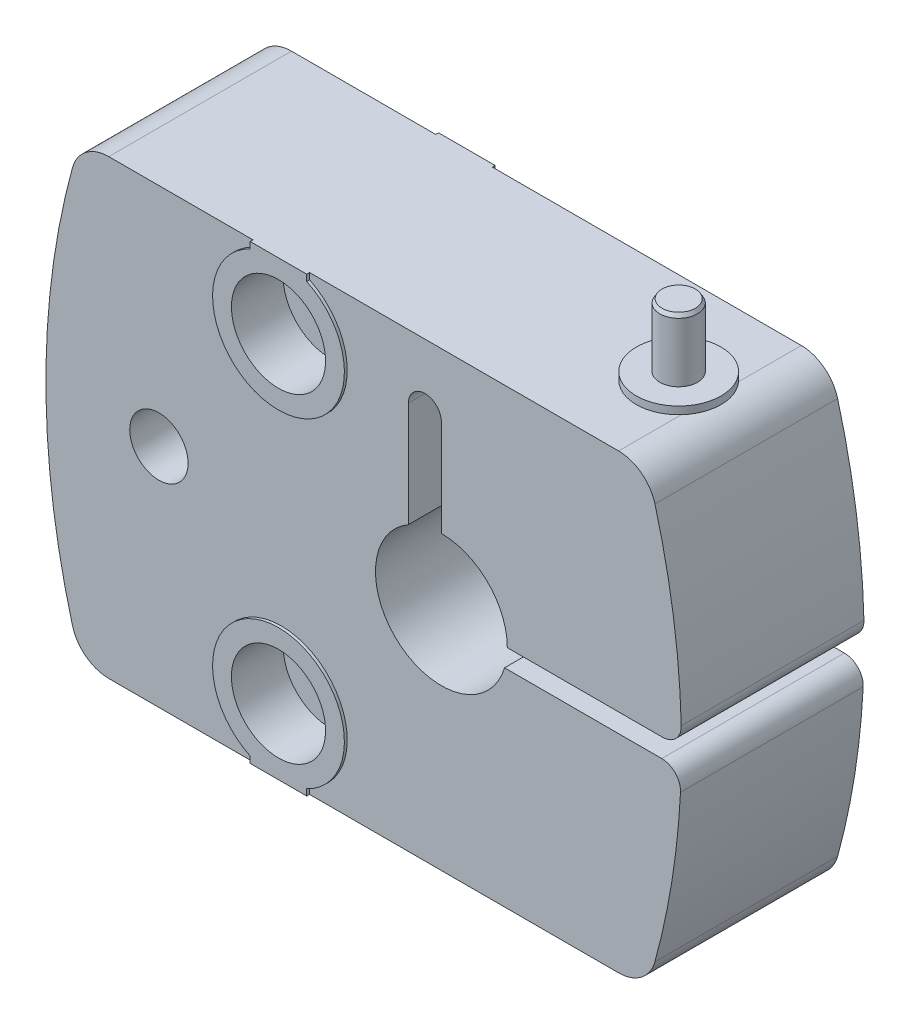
ISO-10303-21;
HEADER;
FILE_DESCRIPTION(('STEP AP214'),'2;1');
FILE_NAME('part.step','',(''),(''),'','','');
FILE_SCHEMA(('AUTOMOTIVE_DESIGN { 1 0 10303 214 1 1 1 1 }'));
ENDSEC;
DATA;
#1=APPLICATION_CONTEXT('core data for automotive mechanical design processes');
#2=APPLICATION_PROTOCOL_DEFINITION('international standard','automotive_design',2000,#1);
#3=PRODUCT_CONTEXT('',#1,'mechanical');
#4=PRODUCT('Part','Part','',(#3));
#5=PRODUCT_RELATED_PRODUCT_CATEGORY('part','',(#4));
#6=PRODUCT_DEFINITION_FORMATION('','',#4);
#7=PRODUCT_DEFINITION_CONTEXT('part definition',#1,'design');
#8=PRODUCT_DEFINITION('design','',#6,#7);
#9=PRODUCT_DEFINITION_SHAPE('','',#8);
#10=(LENGTH_UNIT() NAMED_UNIT(*) SI_UNIT(.MILLI.,.METRE.));
#11=(NAMED_UNIT(*) PLANE_ANGLE_UNIT() SI_UNIT($,.RADIAN.));
#12=(NAMED_UNIT(*) SI_UNIT($,.STERADIAN.) SOLID_ANGLE_UNIT());
#13=UNCERTAINTY_MEASURE_WITH_UNIT(LENGTH_MEASURE(1.E-05),#10,'distance_accuracy_value','');
#14=(GEOMETRIC_REPRESENTATION_CONTEXT(3) GLOBAL_UNCERTAINTY_ASSIGNED_CONTEXT((#13)) GLOBAL_UNIT_ASSIGNED_CONTEXT((#10,
#11,#12)) REPRESENTATION_CONTEXT('',''));
#15=CARTESIAN_POINT('',(0.,0.,0.));
#16=DIRECTION('',(0.,0.,1.));
#17=DIRECTION('',(1.,0.,0.));
#18=AXIS2_PLACEMENT_3D('',#15,#16,#17);
#19=CARTESIAN_POINT('',(18.8212111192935,24.,20.));
#20=DIRECTION('',(0.,-1.,0.));
#21=DIRECTION('',(0.,0.,1.));
#22=AXIS2_PLACEMENT_3D('',#19,#20,#21);
#23=PLANE('',#22);
#24=CARTESIAN_POINT('',(15.5,24.,10.));
#25=DIRECTION('',(0.,1.,0.));
#26=DIRECTION('',(0.,0.,-1.));
#27=AXIS2_PLACEMENT_3D('',#24,#25,#26);
#28=CIRCLE('',#27,4.5);
#29=CARTESIAN_POINT('',(18.8212111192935,24.,6.96362770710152));
#30=VERTEX_POINT('',#29);
#31=CARTESIAN_POINT('',(18.8212111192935,24.,13.0363722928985));
#32=VERTEX_POINT('',#31);
#33=EDGE_CURVE('E34',#30,#32,#28,.T.);
#34=ORIENTED_EDGE('',*,*,#33,.F.);
#35=DIRECTION('',(0.,0.,-1.));
#36=VECTOR('',#35,1.);
#37=CARTESIAN_POINT('',(18.8212111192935,24.,20.));
#38=LINE('',#37,#36);
#39=CARTESIAN_POINT('',(18.8212111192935,24.,0.3));
#40=VERTEX_POINT('',#39);
#41=EDGE_CURVE('E253',#30,#40,#38,.T.);
#42=ORIENTED_EDGE('',*,*,#41,.T.);
#43=DIRECTION('',(1.,0.,0.));
#44=VECTOR('',#43,1.);
#45=CARTESIAN_POINT('',(-14.,24.,0.3));
#46=LINE('',#45,#44);
#47=CARTESIAN_POINT('',(-14.,24.,0.3));
#48=VERTEX_POINT('',#47);
#49=EDGE_CURVE('E412',#48,#40,#46,.T.);
#50=ORIENTED_EDGE('',*,*,#49,.F.);
#51=DIRECTION('',(0.,0.,-1.));
#52=VECTOR('',#51,1.);
#53=CARTESIAN_POINT('',(-14.,24.,0.3));
#54=LINE('',#53,#52);
#55=CARTESIAN_POINT('',(-14.,24.,0.));
#56=VERTEX_POINT('',#55);
#57=EDGE_CURVE('E503',#48,#56,#54,.T.);
#58=ORIENTED_EDGE('',*,*,#57,.T.);
#59=DIRECTION('',(-1.,0.,0.));
#60=VECTOR('',#59,1.);
#61=CARTESIAN_POINT('',(18.8212111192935,24.,0.));
#62=LINE('',#61,#60);
#63=CARTESIAN_POINT('',(-20.,24.,0.));
#64=VERTEX_POINT('',#63);
#65=EDGE_CURVE('E496',#56,#64,#62,.T.);
#66=ORIENTED_EDGE('',*,*,#65,.T.);
#67=DIRECTION('',(0.,0.,-1.));
#68=VECTOR('',#67,1.);
#69=CARTESIAN_POINT('',(-20.,24.,0.3));
#70=LINE('',#69,#68);
#71=CARTESIAN_POINT('',(-20.,24.,0.3));
#72=VERTEX_POINT('',#71);
#73=EDGE_CURVE('E478',#72,#64,#70,.T.);
#74=ORIENTED_EDGE('',*,*,#73,.F.);
#75=DIRECTION('',(1.,0.,0.));
#76=VECTOR('',#75,1.);
#77=CARTESIAN_POINT('',(-35.3212111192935,24.,0.3));
#78=LINE('',#77,#76);
#79=CARTESIAN_POINT('',(-35.3212111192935,24.,0.3));
#80=VERTEX_POINT('',#79);
#81=EDGE_CURVE('E399',#80,#72,#78,.T.);
#82=ORIENTED_EDGE('',*,*,#81,.F.);
#83=DIRECTION('',(0.,0.,-1.));
#84=VECTOR('',#83,1.);
#85=CARTESIAN_POINT('',(-35.3212111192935,24.,20.));
#86=LINE('',#85,#84);
#87=CARTESIAN_POINT('',(-35.3212111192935,24.,19.7));
#88=VERTEX_POINT('',#87);
#89=EDGE_CURVE('E546',#88,#80,#86,.T.);
#90=ORIENTED_EDGE('',*,*,#89,.F.);
#91=DIRECTION('',(-1.,0.,0.));
#92=VECTOR('',#91,1.);
#93=CARTESIAN_POINT('',(-20.,24.,19.7));
#94=LINE('',#93,#92);
#95=CARTESIAN_POINT('',(-20.,24.,19.7));
#96=VERTEX_POINT('',#95);
#97=EDGE_CURVE('E329',#96,#88,#94,.T.);
#98=ORIENTED_EDGE('',*,*,#97,.F.);
#99=DIRECTION('',(0.,0.,1.));
#100=VECTOR('',#99,1.);
#101=CARTESIAN_POINT('',(-20.,24.,-82.5057277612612));
#102=LINE('',#101,#100);
#103=CARTESIAN_POINT('',(-20.,24.,20.));
#104=VERTEX_POINT('',#103);
#105=EDGE_CURVE('E331',#96,#104,#102,.T.);
#106=ORIENTED_EDGE('',*,*,#105,.T.);
#107=DIRECTION('',(-1.,0.,0.));
#108=VECTOR('',#107,1.);
#109=CARTESIAN_POINT('',(18.8212111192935,24.,20.));
#110=LINE('',#109,#108);
#111=CARTESIAN_POINT('',(-14.,24.,20.));
#112=VERTEX_POINT('',#111);
#113=EDGE_CURVE('E511',#112,#104,#110,.T.);
#114=ORIENTED_EDGE('',*,*,#113,.F.);
#115=DIRECTION('',(0.,0.,1.));
#116=VECTOR('',#115,1.);
#117=CARTESIAN_POINT('',(-14.,24.,-82.5057277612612));
#118=LINE('',#117,#116);
#119=CARTESIAN_POINT('',(-14.,24.,19.7));
#120=VERTEX_POINT('',#119);
#121=EDGE_CURVE('E343',#120,#112,#118,.T.);
#122=ORIENTED_EDGE('',*,*,#121,.F.);
#123=DIRECTION('',(-1.,0.,0.));
#124=VECTOR('',#123,1.);
#125=CARTESIAN_POINT('',(18.8212111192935,24.,19.7));
#126=LINE('',#125,#124);
#127=CARTESIAN_POINT('',(18.8212111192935,24.,19.7));
#128=VERTEX_POINT('',#127);
#129=EDGE_CURVE('E249',#128,#120,#126,.T.);
#130=ORIENTED_EDGE('',*,*,#129,.F.);
#131=EDGE_CURVE('E245',#128,#32,#38,.T.);
#132=ORIENTED_EDGE('',*,*,#131,.T.);
#133=EDGE_LOOP('',(#34,#42,#50,#58,#66,#74,#82,#90,#98,#106,#114,#122,#130,#132));
#134=FACE_BOUND('',#133,.T.);
#135=ADVANCED_FACE('F18',(#134),#23,.F.);
#136=CARTESIAN_POINT('',(-17.,17.,20.));
#137=DIRECTION('',(0.,0.,-1.));
#138=DIRECTION('',(0.,-1.,0.));
#139=AXIS2_PLACEMENT_3D('',#136,#137,#138);
#140=CYLINDRICAL_SURFACE('',#139,2.75);
#141=CARTESIAN_POINT('',(-17.,17.,5.5));
#142=DIRECTION('',(0.,0.,-1.));
#143=DIRECTION('',(0.,-1.,0.));
#144=AXIS2_PLACEMENT_3D('',#141,#142,#143);
#145=CIRCLE('',#144,2.75);
#146=CARTESIAN_POINT('',(-17.,14.25,5.5));
#147=VERTEX_POINT('',#146);
#148=EDGE_CURVE('E304',#147,#147,#145,.T.);
#149=ORIENTED_EDGE('',*,*,#148,.T.);
#150=EDGE_LOOP('',(#149));
#151=FACE_BOUND('',#150,.T.);
#152=CARTESIAN_POINT('',(-17.,17.,14.5));
#153=DIRECTION('',(0.,0.,1.));
#154=DIRECTION('',(0.,1.,0.));
#155=AXIS2_PLACEMENT_3D('',#152,#153,#154);
#156=CIRCLE('',#155,2.75);
#157=CARTESIAN_POINT('',(-17.,19.75,14.5));
#158=VERTEX_POINT('',#157);
#159=EDGE_CURVE('E284',#158,#158,#156,.T.);
#160=ORIENTED_EDGE('',*,*,#159,.T.);
#161=EDGE_LOOP('',(#160));
#162=FACE_BOUND('',#161,.T.);
#163=ADVANCED_FACE('F588',(#151,#162),#140,.F.);
#164=CARTESIAN_POINT('',(-17.,-17.,20.));
#165=DIRECTION('',(0.,0.,-1.));
#166=DIRECTION('',(0.,-1.,0.));
#167=AXIS2_PLACEMENT_3D('',#164,#165,#166);
#168=CYLINDRICAL_SURFACE('',#167,2.75);
#169=CARTESIAN_POINT('',(-17.,-17.,5.5));
#170=DIRECTION('',(0.,0.,-1.));
#171=DIRECTION('',(0.,-1.,0.));
#172=AXIS2_PLACEMENT_3D('',#169,#170,#171);
#173=CIRCLE('',#172,2.75);
#174=CARTESIAN_POINT('',(-17.,-19.75,5.5));
#175=VERTEX_POINT('',#174);
#176=EDGE_CURVE('E297',#175,#175,#173,.T.);
#177=ORIENTED_EDGE('',*,*,#176,.T.);
#178=EDGE_LOOP('',(#177));
#179=FACE_BOUND('',#178,.T.);
#180=CARTESIAN_POINT('',(-17.,-17.,14.5));
#181=DIRECTION('',(0.,0.,1.));
#182=DIRECTION('',(0.,1.,0.));
#183=AXIS2_PLACEMENT_3D('',#180,#181,#182);
#184=CIRCLE('',#183,2.75);
#185=CARTESIAN_POINT('',(-17.,-14.25,14.5));
#186=VERTEX_POINT('',#185);
#187=EDGE_CURVE('E290',#186,#186,#184,.T.);
#188=ORIENTED_EDGE('',*,*,#187,.T.);
#189=EDGE_LOOP('',(#188));
#190=FACE_BOUND('',#189,.T.);
#191=ADVANCED_FACE('F594',(#179,#190),#168,.F.);
#192=CARTESIAN_POINT('',(0.,0.,20.));
#193=DIRECTION('',(0.,0.,1.));
#194=DIRECTION('',(0.,1.,0.));
#195=AXIS2_PLACEMENT_3D('',#192,#193,#194);
#196=PLANE('',#195);
#197=CARTESIAN_POINT('',(-17.,-17.,20.));
#198=DIRECTION('',(0.,0.,1.));
#199=DIRECTION('',(0.,1.,0.));
#200=AXIS2_PLACEMENT_3D('',#197,#198,#199);
#201=CIRCLE('',#200,5.);
#202=CARTESIAN_POINT('',(-17.,-12.,20.));
#203=VERTEX_POINT('',#202);
#204=EDGE_CURVE('E291',#203,#203,#201,.T.);
#205=ORIENTED_EDGE('',*,*,#204,.F.);
#206=EDGE_LOOP('',(#205));
#207=FACE_BOUND('',#206,.T.);
#208=DIRECTION('',(0.,1.,0.));
#209=VECTOR('',#208,1.);
#210=CARTESIAN_POINT('',(-20.,-24.,20.));
#211=LINE('',#210,#209);
#212=CARTESIAN_POINT('',(-20.,-24.,20.));
#213=VERTEX_POINT('',#212);
#214=CARTESIAN_POINT('',(-20.,-23.3245553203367,20.));
#215=VERTEX_POINT('',#214);
#216=EDGE_CURVE('E321',#213,#215,#211,.T.);
#217=ORIENTED_EDGE('',*,*,#216,.F.);
#218=DIRECTION('',(1.,0.,0.));
#219=VECTOR('',#218,1.);
#220=CARTESIAN_POINT('',(-35.3212111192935,-24.,20.));
#221=LINE('',#220,#219);
#222=CARTESIAN_POINT('',(-14.,-24.,20.));
#223=VERTEX_POINT('',#222);
#224=EDGE_CURVE('E514',#213,#223,#221,.T.);
#225=ORIENTED_EDGE('',*,*,#224,.T.);
#226=DIRECTION('',(0.,-1.,0.));
#227=VECTOR('',#226,1.);
#228=CARTESIAN_POINT('',(-14.,-23.3245553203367,20.));
#229=LINE('',#228,#227);
#230=CARTESIAN_POINT('',(-14.,-23.3245553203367,20.));
#231=VERTEX_POINT('',#230);
#232=EDGE_CURVE('E42',#231,#223,#229,.T.);
#233=ORIENTED_EDGE('',*,*,#232,.F.);
#234=CARTESIAN_POINT('',(-17.,-17.,20.));
#235=DIRECTION('',(0.,0.,-1.));
#236=DIRECTION('',(0.,1.,0.));
#237=AXIS2_PLACEMENT_3D('',#234,#235,#236);
#238=CIRCLE('',#237,7.);
#239=EDGE_CURVE('E318',#215,#231,#238,.T.);
#240=ORIENTED_EDGE('',*,*,#239,.F.);
#241=EDGE_LOOP('',(#217,#225,#233,#240));
#242=FACE_BOUND('',#241,.T.);
#243=ADVANCED_FACE('F622',(#207,#242),#196,.T.);
#244=CARTESIAN_POINT('',(0.,0.,0.));
#245=DIRECTION('',(0.,0.,1.));
#246=DIRECTION('',(0.,1.,0.));
#247=AXIS2_PLACEMENT_3D('',#244,#245,#246);
#248=PLANE('',#247);
#249=CARTESIAN_POINT('',(-17.,-17.,0.));
#250=DIRECTION('',(0.,0.,-1.));
#251=DIRECTION('',(0.,-1.,0.));
#252=AXIS2_PLACEMENT_3D('',#249,#250,#251);
#253=CIRCLE('',#252,5.);
#254=CARTESIAN_POINT('',(-17.,-22.,0.));
#255=VERTEX_POINT('',#254);
#256=EDGE_CURVE('E298',#255,#255,#253,.T.);
#257=ORIENTED_EDGE('',*,*,#256,.F.);
#258=EDGE_LOOP('',(#257));
#259=FACE_BOUND('',#258,.T.);
#260=DIRECTION('',(1.,0.,0.));
#261=VECTOR('',#260,1.);
#262=CARTESIAN_POINT('',(-35.3212111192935,-24.,0.));
#263=LINE('',#262,#261);
#264=CARTESIAN_POINT('',(-20.,-24.,0.));
#265=VERTEX_POINT('',#264);
#266=CARTESIAN_POINT('',(-14.,-24.,0.));
#267=VERTEX_POINT('',#266);
#268=EDGE_CURVE('E515',#265,#267,#263,.T.);
#269=ORIENTED_EDGE('',*,*,#268,.F.);
#270=DIRECTION('',(0.,-1.,0.));
#271=VECTOR('',#270,1.);
#272=CARTESIAN_POINT('',(-20.,-23.3245553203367,0.));
#273=LINE('',#272,#271);
#274=CARTESIAN_POINT('',(-20.,-23.3245553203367,0.));
#275=VERTEX_POINT('',#274);
#276=EDGE_CURVE('E403',#275,#265,#273,.T.);
#277=ORIENTED_EDGE('',*,*,#276,.F.);
#278=CARTESIAN_POINT('',(-17.,-17.,0.));
#279=DIRECTION('',(0.,0.,1.));
#280=DIRECTION('',(0.,1.,0.));
#281=AXIS2_PLACEMENT_3D('',#278,#279,#280);
#282=CIRCLE('',#281,7.);
#283=CARTESIAN_POINT('',(-14.,-23.3245553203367,0.));
#284=VERTEX_POINT('',#283);
#285=EDGE_CURVE('E489',#284,#275,#282,.T.);
#286=ORIENTED_EDGE('',*,*,#285,.F.);
#287=DIRECTION('',(0.,1.,0.));
#288=VECTOR('',#287,1.);
#289=CARTESIAN_POINT('',(-14.,-23.3245553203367,0.));
#290=LINE('',#289,#288);
#291=EDGE_CURVE('E486',#267,#284,#290,.T.);
#292=ORIENTED_EDGE('',*,*,#291,.F.);
#293=EDGE_LOOP('',(#269,#277,#286,#292));
#294=FACE_BOUND('',#293,.T.);
#295=ADVANCED_FACE('F616',(#259,#294),#248,.F.);
#296=CARTESIAN_POINT('',(0.,0.,20.));
#297=DIRECTION('',(0.,0.,-1.));
#298=DIRECTION('',(0.,-1.,0.));
#299=AXIS2_PLACEMENT_3D('',#296,#297,#298);
#300=CYLINDRICAL_SURFACE('',#299,7.);
#301=DIRECTION('',(0.,0.,-1.));
#302=VECTOR('',#301,1.);
#303=CARTESIAN_POINT('',(7.,0.,20.));
#304=LINE('',#303,#302);
#305=CARTESIAN_POINT('',(7.,0.,19.7));
#306=VERTEX_POINT('',#305);
#307=CARTESIAN_POINT('',(7.,0.,0.3));
#308=VERTEX_POINT('',#307);
#309=EDGE_CURVE('E553',#306,#308,#304,.T.);
#310=ORIENTED_EDGE('',*,*,#309,.F.);
#311=CARTESIAN_POINT('',(0.,0.,19.7));
#312=DIRECTION('',(0.,0.,-1.));
#313=DIRECTION('',(0.,-1.,0.));
#314=AXIS2_PLACEMENT_3D('',#311,#312,#313);
#315=CIRCLE('',#314,7.);
#316=CARTESIAN_POINT('',(0.,7.,19.7));
#317=VERTEX_POINT('',#316);
#318=EDGE_CURVE('E353',#317,#306,#315,.T.);
#319=ORIENTED_EDGE('',*,*,#318,.F.);
#320=DIRECTION('',(0.,0.,-1.));
#321=VECTOR('',#320,1.);
#322=CARTESIAN_POINT('',(0.,7.,20.));
#323=LINE('',#322,#321);
#324=CARTESIAN_POINT('',(0.,7.,0.3));
#325=VERTEX_POINT('',#324);
#326=EDGE_CURVE('E518',#317,#325,#323,.T.);
#327=ORIENTED_EDGE('',*,*,#326,.T.);
#328=CARTESIAN_POINT('',(0.,0.,0.3));
#329=DIRECTION('',(0.,0.,1.));
#330=DIRECTION('',(0.,-1.,0.));
#331=AXIS2_PLACEMENT_3D('',#328,#329,#330);
#332=CIRCLE('',#331,7.);
#333=EDGE_CURVE('E427',#308,#325,#332,.T.);
#334=ORIENTED_EDGE('',*,*,#333,.F.);
#335=EDGE_LOOP('',(#310,#319,#327,#334));
#336=FACE_BOUND('',#335,.T.);
#337=ADVANCED_FACE('F613',(#336),#300,.F.);
#338=CARTESIAN_POINT('',(7.,0.,20.));
#339=DIRECTION('',(0.,1.,0.));
#340=DIRECTION('',(-1.,0.,0.));
#341=AXIS2_PLACEMENT_3D('',#338,#339,#340);
#342=PLANE('',#341);
#343=CARTESIAN_POINT('',(15.5,0.,10.));
#344=DIRECTION('',(0.,1.,0.));
#345=DIRECTION('',(-1.,0.,0.));
#346=AXIS2_PLACEMENT_3D('',#343,#344,#345);
#347=CIRCLE('',#346,2.);
#348=CARTESIAN_POINT('',(13.5,0.,10.));
#349=VERTEX_POINT('',#348);
#350=EDGE_CURVE('E277',#349,#349,#347,.T.);
#351=ORIENTED_EDGE('',*,*,#350,.T.);
#352=EDGE_LOOP('',(#351));
#353=FACE_BOUND('',#352,.T.);
#354=DIRECTION('',(0.,0.,-1.));
#355=VECTOR('',#354,1.);
#356=CARTESIAN_POINT('',(23.4743547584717,0.,20.));
#357=LINE('',#356,#355);
#358=CARTESIAN_POINT('',(23.4743547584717,0.,19.7));
#359=VERTEX_POINT('',#358);
#360=CARTESIAN_POINT('',(23.4743547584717,0.,0.3));
#361=VERTEX_POINT('',#360);
#362=EDGE_CURVE('E551',#359,#361,#357,.T.);
#363=ORIENTED_EDGE('',*,*,#362,.F.);
#364=DIRECTION('',(1.,0.,0.));
#365=VECTOR('',#364,1.);
#366=CARTESIAN_POINT('',(7.,0.,19.7));
#367=LINE('',#366,#365);
#368=EDGE_CURVE('E351',#306,#359,#367,.T.);
#369=ORIENTED_EDGE('',*,*,#368,.F.);
#370=ORIENTED_EDGE('',*,*,#309,.T.);
#371=DIRECTION('',(-1.,0.,0.));
#372=VECTOR('',#371,1.);
#373=CARTESIAN_POINT('',(23.4743547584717,0.,0.3));
#374=LINE('',#373,#372);
#375=EDGE_CURVE('E424',#361,#308,#374,.T.);
#376=ORIENTED_EDGE('',*,*,#375,.F.);
#377=EDGE_LOOP('',(#363,#369,#370,#376));
#378=FACE_BOUND('',#377,.T.);
#379=ADVANCED_FACE('F610',(#353,#378),#342,.F.);
#380=CARTESIAN_POINT('',(23.4743547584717,2.,20.));
#381=DIRECTION('',(0.,0.,-1.));
#382=DIRECTION('',(0.,-1.,0.));
#383=AXIS2_PLACEMENT_3D('',#380,#381,#382);
#384=CYLINDRICAL_SURFACE('',#383,2.);
#385=DIRECTION('',(0.,0.,-1.));
#386=VECTOR('',#385,1.);
#387=CARTESIAN_POINT('',(25.4736971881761,2.05128205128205,20.));
#388=LINE('',#387,#386);
#389=CARTESIAN_POINT('',(25.4736971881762,2.05128205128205,19.7));
#390=VERTEX_POINT('',#389);
#391=CARTESIAN_POINT('',(25.4736971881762,2.05128205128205,0.3));
#392=VERTEX_POINT('',#391);
#393=EDGE_CURVE('E549',#390,#392,#388,.T.);
#394=ORIENTED_EDGE('',*,*,#393,.F.);
#395=CARTESIAN_POINT('',(23.4743547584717,2.,19.7));
#396=DIRECTION('',(0.,0.,-1.));
#397=DIRECTION('',(0.,-1.,0.));
#398=AXIS2_PLACEMENT_3D('',#395,#396,#397);
#399=CIRCLE('',#398,2.);
#400=EDGE_CURVE('E349',#359,#390,#399,.F.);
#401=ORIENTED_EDGE('',*,*,#400,.F.);
#402=ORIENTED_EDGE('',*,*,#362,.T.);
#403=CARTESIAN_POINT('',(23.4743547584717,2.,0.3));
#404=DIRECTION('',(0.,0.,-1.));
#405=DIRECTION('',(0.,-1.,0.));
#406=AXIS2_PLACEMENT_3D('',#403,#404,#405);
#407=CIRCLE('',#406,2.);
#408=EDGE_CURVE('E421',#392,#361,#407,.T.);
#409=ORIENTED_EDGE('',*,*,#408,.F.);
#410=EDGE_LOOP('',(#394,#401,#402,#409));
#411=FACE_BOUND('',#410,.T.);
#412=ADVANCED_FACE('F606',(#411),#384,.T.);
#413=CARTESIAN_POINT('',(-54.5,0.,20.));
#414=DIRECTION('',(0.,0.,-1.));
#415=DIRECTION('',(0.,-1.,0.));
#416=AXIS2_PLACEMENT_3D('',#413,#414,#415);
#417=CYLINDRICAL_SURFACE('',#416,80.);
#418=DIRECTION('',(0.,0.,-1.));
#419=VECTOR('',#418,1.);
#420=CARTESIAN_POINT('',(22.6802222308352,21.0526315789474,20.));
#421=LINE('',#420,#419);
#422=CARTESIAN_POINT('',(22.6802222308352,21.0526315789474,19.7));
#423=VERTEX_POINT('',#422);
#424=CARTESIAN_POINT('',(22.6802222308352,21.0526315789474,0.3));
#425=VERTEX_POINT('',#424);
#426=EDGE_CURVE('E252',#423,#425,#421,.T.);
#427=ORIENTED_EDGE('',*,*,#426,.F.);
#428=CARTESIAN_POINT('',(-54.5,0.,19.7));
#429=DIRECTION('',(0.,0.,-1.));
#430=DIRECTION('',(0.,-1.,0.));
#431=AXIS2_PLACEMENT_3D('',#428,#429,#430);
#432=CIRCLE('',#431,80.);
#433=EDGE_CURVE('E347',#390,#423,#432,.F.);
#434=ORIENTED_EDGE('',*,*,#433,.F.);
#435=ORIENTED_EDGE('',*,*,#393,.T.);
#436=CARTESIAN_POINT('',(-54.5,0.,0.3));
#437=DIRECTION('',(0.,0.,-1.));
#438=DIRECTION('',(0.,-1.,0.));
#439=AXIS2_PLACEMENT_3D('',#436,#437,#438);
#440=CIRCLE('',#439,80.);
#441=EDGE_CURVE('E418',#425,#392,#440,.T.);
#442=ORIENTED_EDGE('',*,*,#441,.F.);
#443=EDGE_LOOP('',(#427,#434,#435,#442));
#444=FACE_BOUND('',#443,.T.);
#445=ADVANCED_FACE('F603',(#444),#417,.T.);
#446=CARTESIAN_POINT('',(18.8212111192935,20.,20.));
#447=DIRECTION('',(0.,0.,-1.));
#448=DIRECTION('',(0.,-1.,0.));
#449=AXIS2_PLACEMENT_3D('',#446,#447,#448);
#450=CYLINDRICAL_SURFACE('',#449,4.);
#451=ORIENTED_EDGE('',*,*,#131,.F.);
#452=CARTESIAN_POINT('',(18.8212111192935,20.,19.7));
#453=DIRECTION('',(0.,0.,-1.));
#454=DIRECTION('',(0.,-1.,0.));
#455=AXIS2_PLACEMENT_3D('',#452,#453,#454);
#456=CIRCLE('',#455,4.);
#457=EDGE_CURVE('E345',#423,#128,#456,.F.);
#458=ORIENTED_EDGE('',*,*,#457,.F.);
#459=ORIENTED_EDGE('',*,*,#426,.T.);
#460=CARTESIAN_POINT('',(18.8212111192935,20.,0.3));
#461=DIRECTION('',(0.,0.,-1.));
#462=DIRECTION('',(0.,-1.,0.));
#463=AXIS2_PLACEMENT_3D('',#460,#461,#462);
#464=CIRCLE('',#463,4.);
#465=EDGE_CURVE('E415',#40,#425,#464,.T.);
#466=ORIENTED_EDGE('',*,*,#465,.F.);
#467=ORIENTED_EDGE('',*,*,#41,.F.);
#468=DIRECTION('',(0.,0.,-1.));
#469=VECTOR('',#468,1.);
#470=CARTESIAN_POINT('',(18.8212111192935,24.,20.));
#471=LINE('',#470,#469);
#472=EDGE_CURVE('E256',#32,#30,#471,.T.);
#473=ORIENTED_EDGE('',*,*,#472,.F.);
#474=EDGE_LOOP('',(#451,#458,#459,#466,#467,#473));
#475=FACE_BOUND('',#474,.T.);
#476=ADVANCED_FACE('F257',(#475),#450,.T.);
#477=CARTESIAN_POINT('',(-35.3212111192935,20.,20.));
#478=DIRECTION('',(0.,0.,-1.));
#479=DIRECTION('',(0.,-1.,0.));
#480=AXIS2_PLACEMENT_3D('',#477,#478,#479);
#481=CYLINDRICAL_SURFACE('',#480,4.);
#482=DIRECTION('',(0.,0.,-1.));
#483=VECTOR('',#482,1.);
#484=CARTESIAN_POINT('',(-39.1802222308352,21.0526315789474,20.));
#485=LINE('',#484,#483);
#486=CARTESIAN_POINT('',(-39.1802222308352,21.0526315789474,19.7));
#487=VERTEX_POINT('',#486);
#488=CARTESIAN_POINT('',(-39.1802222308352,21.0526315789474,0.3));
#489=VERTEX_POINT('',#488);
#490=EDGE_CURVE('E544',#487,#489,#485,.T.);
#491=ORIENTED_EDGE('',*,*,#490,.F.);
#492=CARTESIAN_POINT('',(-35.3212111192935,20.,19.7));
#493=DIRECTION('',(0.,0.,-1.));
#494=DIRECTION('',(0.,-1.,0.));
#495=AXIS2_PLACEMENT_3D('',#492,#493,#494);
#496=CIRCLE('',#495,4.);
#497=EDGE_CURVE('E326',#88,#487,#496,.F.);
#498=ORIENTED_EDGE('',*,*,#497,.F.);
#499=ORIENTED_EDGE('',*,*,#89,.T.);
#500=CARTESIAN_POINT('',(-35.3212111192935,20.,0.3));
#501=DIRECTION('',(0.,0.,-1.));
#502=DIRECTION('',(0.,-1.,0.));
#503=AXIS2_PLACEMENT_3D('',#500,#501,#502);
#504=CIRCLE('',#503,4.);
#505=EDGE_CURVE('E475',#489,#80,#504,.T.);
#506=ORIENTED_EDGE('',*,*,#505,.F.);
#507=EDGE_LOOP('',(#491,#498,#499,#506));
#508=FACE_BOUND('',#507,.T.);
#509=ADVANCED_FACE('F599',(#508),#481,.T.);
#510=CARTESIAN_POINT('',(38.,0.,20.));
#511=DIRECTION('',(0.,0.,-1.));
#512=DIRECTION('',(0.,-1.,0.));
#513=AXIS2_PLACEMENT_3D('',#510,#511,#512);
#514=CYLINDRICAL_SURFACE('',#513,80.);
#515=DIRECTION('',(0.,0.,-1.));
#516=VECTOR('',#515,1.);
#517=CARTESIAN_POINT('',(-39.1802222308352,-21.0526315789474,20.));
#518=LINE('',#517,#516);
#519=CARTESIAN_POINT('',(-39.1802222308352,-21.0526315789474,19.7));
#520=VERTEX_POINT('',#519);
#521=CARTESIAN_POINT('',(-39.1802222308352,-21.0526315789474,0.3));
#522=VERTEX_POINT('',#521);
#523=EDGE_CURVE('E542',#520,#522,#518,.T.);
#524=ORIENTED_EDGE('',*,*,#523,.F.);
#525=CARTESIAN_POINT('',(38.,0.,19.7));
#526=DIRECTION('',(0.,0.,-1.));
#527=DIRECTION('',(0.,-1.,0.));
#528=AXIS2_PLACEMENT_3D('',#525,#526,#527);
#529=CIRCLE('',#528,80.);
#530=EDGE_CURVE('E310',#487,#520,#529,.F.);
#531=ORIENTED_EDGE('',*,*,#530,.F.);
#532=ORIENTED_EDGE('',*,*,#490,.T.);
#533=CARTESIAN_POINT('',(38.,0.,0.3));
#534=DIRECTION('',(0.,0.,-1.));
#535=DIRECTION('',(0.,-1.,0.));
#536=AXIS2_PLACEMENT_3D('',#533,#534,#535);
#537=CIRCLE('',#536,80.);
#538=EDGE_CURVE('E472',#522,#489,#537,.T.);
#539=ORIENTED_EDGE('',*,*,#538,.F.);
#540=EDGE_LOOP('',(#524,#531,#532,#539));
#541=FACE_BOUND('',#540,.T.);
#542=ADVANCED_FACE('F669',(#541),#514,.T.);
#543=CARTESIAN_POINT('',(-35.3212111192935,-20.,20.));
#544=DIRECTION('',(0.,0.,-1.));
#545=DIRECTION('',(0.,-1.,0.));
#546=AXIS2_PLACEMENT_3D('',#543,#544,#545);
#547=CYLINDRICAL_SURFACE('',#546,4.);
#548=DIRECTION('',(0.,0.,-1.));
#549=VECTOR('',#548,1.);
#550=CARTESIAN_POINT('',(-35.3212111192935,-24.,20.));
#551=LINE('',#550,#549);
#552=CARTESIAN_POINT('',(-35.3212111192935,-24.,19.7));
#553=VERTEX_POINT('',#552);
#554=CARTESIAN_POINT('',(-35.3212111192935,-24.,0.3));
#555=VERTEX_POINT('',#554);
#556=EDGE_CURVE('E540',#553,#555,#551,.T.);
#557=ORIENTED_EDGE('',*,*,#556,.F.);
#558=CARTESIAN_POINT('',(-35.3212111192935,-20.,19.7));
#559=DIRECTION('',(0.,0.,-1.));
#560=DIRECTION('',(0.,-1.,0.));
#561=AXIS2_PLACEMENT_3D('',#558,#559,#560);
#562=CIRCLE('',#561,4.);
#563=EDGE_CURVE('E325',#520,#553,#562,.F.);
#564=ORIENTED_EDGE('',*,*,#563,.F.);
#565=ORIENTED_EDGE('',*,*,#523,.T.);
#566=CARTESIAN_POINT('',(-35.3212111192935,-20.,0.3));
#567=DIRECTION('',(0.,0.,-1.));
#568=DIRECTION('',(0.,-1.,0.));
#569=AXIS2_PLACEMENT_3D('',#566,#567,#568);
#570=CIRCLE('',#569,4.);
#571=EDGE_CURVE('E469',#555,#522,#570,.T.);
#572=ORIENTED_EDGE('',*,*,#571,.F.);
#573=EDGE_LOOP('',(#557,#564,#565,#572));
#574=FACE_BOUND('',#573,.T.);
#575=ADVANCED_FACE('F673',(#574),#547,.T.);
#576=CARTESIAN_POINT('',(18.8212111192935,-20.,20.));
#577=DIRECTION('',(0.,0.,-1.));
#578=DIRECTION('',(0.,-1.,0.));
#579=AXIS2_PLACEMENT_3D('',#576,#577,#578);
#580=CYLINDRICAL_SURFACE('',#579,4.);
#581=DIRECTION('',(0.,0.,-1.));
#582=VECTOR('',#581,1.);
#583=CARTESIAN_POINT('',(22.6802222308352,-21.0526315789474,20.));
#584=LINE('',#583,#582);
#585=CARTESIAN_POINT('',(22.6802222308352,-21.0526315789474,19.7));
#586=VERTEX_POINT('',#585);
#587=CARTESIAN_POINT('',(22.6802222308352,-21.0526315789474,0.3));
#588=VERTEX_POINT('',#587);
#589=EDGE_CURVE('E536',#586,#588,#584,.T.);
#590=ORIENTED_EDGE('',*,*,#589,.F.);
#591=CARTESIAN_POINT('',(18.8212111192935,-20.,19.7));
#592=DIRECTION('',(0.,0.,-1.));
#593=DIRECTION('',(0.,-1.,0.));
#594=AXIS2_PLACEMENT_3D('',#591,#592,#593);
#595=CIRCLE('',#594,4.);
#596=CARTESIAN_POINT('',(18.8212111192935,-24.,19.7));
#597=VERTEX_POINT('',#596);
#598=EDGE_CURVE('E369',#597,#586,#595,.F.);
#599=ORIENTED_EDGE('',*,*,#598,.F.);
#600=DIRECTION('',(0.,0.,-1.));
#601=VECTOR('',#600,1.);
#602=CARTESIAN_POINT('',(18.8212111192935,-24.,20.));
#603=LINE('',#602,#601);
#604=CARTESIAN_POINT('',(18.8212111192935,-24.,0.3));
#605=VERTEX_POINT('',#604);
#606=EDGE_CURVE('E538',#597,#605,#603,.T.);
#607=ORIENTED_EDGE('',*,*,#606,.T.);
#608=CARTESIAN_POINT('',(18.8212111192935,-20.,0.3));
#609=DIRECTION('',(0.,0.,-1.));
#610=DIRECTION('',(0.,-1.,0.));
#611=AXIS2_PLACEMENT_3D('',#608,#609,#610);
#612=CIRCLE('',#611,4.);
#613=EDGE_CURVE('E451',#588,#605,#612,.T.);
#614=ORIENTED_EDGE('',*,*,#613,.F.);
#615=EDGE_LOOP('',(#590,#599,#607,#614));
#616=FACE_BOUND('',#615,.T.);
#617=ADVANCED_FACE('F699',(#616),#580,.T.);
#618=CARTESIAN_POINT('',(-54.5,0.,20.));
#619=DIRECTION('',(0.,0.,-1.));
#620=DIRECTION('',(0.,-1.,0.));
#621=AXIS2_PLACEMENT_3D('',#618,#619,#620);
#622=CYLINDRICAL_SURFACE('',#621,80.);
#623=DIRECTION('',(0.,0.,-1.));
#624=VECTOR('',#623,1.);
#625=CARTESIAN_POINT('',(25.3947367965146,-4.1025641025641,20.));
#626=LINE('',#625,#624);
#627=CARTESIAN_POINT('',(25.3947367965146,-4.1025641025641,19.7));
#628=VERTEX_POINT('',#627);
#629=CARTESIAN_POINT('',(25.3947367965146,-4.1025641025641,0.3));
#630=VERTEX_POINT('',#629);
#631=EDGE_CURVE('E534',#628,#630,#626,.T.);
#632=ORIENTED_EDGE('',*,*,#631,.F.);
#633=CARTESIAN_POINT('',(-54.5,0.,19.7));
#634=DIRECTION('',(0.,0.,-1.));
#635=DIRECTION('',(0.,-1.,0.));
#636=AXIS2_PLACEMENT_3D('',#633,#634,#635);
#637=CIRCLE('',#636,80.);
#638=EDGE_CURVE('E367',#586,#628,#637,.F.);
#639=ORIENTED_EDGE('',*,*,#638,.F.);
#640=ORIENTED_EDGE('',*,*,#589,.T.);
#641=CARTESIAN_POINT('',(-54.5,0.,0.3));
#642=DIRECTION('',(0.,0.,-1.));
#643=DIRECTION('',(0.,-1.,0.));
#644=AXIS2_PLACEMENT_3D('',#641,#642,#643);
#645=CIRCLE('',#644,80.);
#646=EDGE_CURVE('E448',#630,#588,#645,.T.);
#647=ORIENTED_EDGE('',*,*,#646,.F.);
#648=EDGE_LOOP('',(#632,#639,#640,#647));
#649=FACE_BOUND('',#648,.T.);
#650=ADVANCED_FACE('F704',(#649),#622,.T.);
#651=CARTESIAN_POINT('',(23.3973683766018,-4.,20.));
#652=DIRECTION('',(0.,0.,-1.));
#653=DIRECTION('',(0.,-1.,0.));
#654=AXIS2_PLACEMENT_3D('',#651,#652,#653);
#655=CYLINDRICAL_SURFACE('',#654,2.);
#656=DIRECTION('',(0.,0.,-1.));
#657=VECTOR('',#656,1.);
#658=CARTESIAN_POINT('',(23.3973683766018,-2.,20.));
#659=LINE('',#658,#657);
#660=CARTESIAN_POINT('',(23.3973683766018,-2.,19.7));
#661=VERTEX_POINT('',#660);
#662=CARTESIAN_POINT('',(23.3973683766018,-2.,0.3));
#663=VERTEX_POINT('',#662);
#664=EDGE_CURVE('E532',#661,#663,#659,.T.);
#665=ORIENTED_EDGE('',*,*,#664,.F.);
#666=CARTESIAN_POINT('',(23.3973683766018,-4.,19.7));
#667=DIRECTION('',(0.,0.,-1.));
#668=DIRECTION('',(0.,-1.,0.));
#669=AXIS2_PLACEMENT_3D('',#666,#667,#668);
#670=CIRCLE('',#669,2.);
#671=EDGE_CURVE('E365',#628,#661,#670,.F.);
#672=ORIENTED_EDGE('',*,*,#671,.F.);
#673=ORIENTED_EDGE('',*,*,#631,.T.);
#674=CARTESIAN_POINT('',(23.3973683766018,-4.,0.3));
#675=DIRECTION('',(0.,0.,-1.));
#676=DIRECTION('',(0.,-1.,0.));
#677=AXIS2_PLACEMENT_3D('',#674,#675,#676);
#678=CIRCLE('',#677,2.);
#679=EDGE_CURVE('E445',#663,#630,#678,.T.);
#680=ORIENTED_EDGE('',*,*,#679,.F.);
#681=EDGE_LOOP('',(#665,#672,#673,#680));
#682=FACE_BOUND('',#681,.T.);
#683=ADVANCED_FACE('F710',(#682),#655,.T.);
#684=CARTESIAN_POINT('',(23.3973683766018,-2.,20.));
#685=DIRECTION('',(0.,-1.,0.));
#686=DIRECTION('',(1.,0.,0.));
#687=AXIS2_PLACEMENT_3D('',#684,#685,#686);
#688=PLANE('',#687);
#689=CARTESIAN_POINT('',(15.5,-2.00000000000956,10.));
#690=DIRECTION('',(0.,-1.,0.));
#691=DIRECTION('',(1.,0.,0.));
#692=AXIS2_PLACEMENT_3D('',#689,#690,#691);
#693=CIRCLE('',#692,2.);
#694=CARTESIAN_POINT('',(17.5,-2.00000000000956,10.));
#695=VERTEX_POINT('',#694);
#696=EDGE_CURVE('E262',#695,#695,#693,.F.);
#697=ORIENTED_EDGE('',*,*,#696,.F.);
#698=EDGE_LOOP('',(#697));
#699=FACE_BOUND('',#698,.T.);
#700=DIRECTION('',(0.,0.,-1.));
#701=VECTOR('',#700,1.);
#702=CARTESIAN_POINT('',(6.70820393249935,-2.,20.));
#703=LINE('',#702,#701);
#704=CARTESIAN_POINT('',(6.70820393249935,-2.,19.7));
#705=VERTEX_POINT('',#704);
#706=CARTESIAN_POINT('',(6.70820393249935,-2.,0.3));
#707=VERTEX_POINT('',#706);
#708=EDGE_CURVE('E530',#705,#707,#703,.T.);
#709=ORIENTED_EDGE('',*,*,#708,.F.);
#710=DIRECTION('',(-1.,0.,0.));
#711=VECTOR('',#710,1.);
#712=CARTESIAN_POINT('',(23.3973683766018,-2.,19.7));
#713=LINE('',#712,#711);
#714=EDGE_CURVE('E363',#661,#705,#713,.T.);
#715=ORIENTED_EDGE('',*,*,#714,.F.);
#716=ORIENTED_EDGE('',*,*,#664,.T.);
#717=DIRECTION('',(1.,0.,0.));
#718=VECTOR('',#717,1.);
#719=CARTESIAN_POINT('',(6.70820393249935,-2.,0.3));
#720=LINE('',#719,#718);
#721=EDGE_CURVE('E442',#707,#663,#720,.T.);
#722=ORIENTED_EDGE('',*,*,#721,.F.);
#723=EDGE_LOOP('',(#709,#715,#716,#722));
#724=FACE_BOUND('',#723,.T.);
#725=ADVANCED_FACE('F714',(#699,#724),#688,.F.);
#726=CARTESIAN_POINT('',(0.,0.,20.));
#727=DIRECTION('',(0.,0.,-1.));
#728=DIRECTION('',(0.,-1.,0.));
#729=AXIS2_PLACEMENT_3D('',#726,#727,#728);
#730=CYLINDRICAL_SURFACE('',#729,7.);
#731=DIRECTION('',(0.,0.,-1.));
#732=VECTOR('',#731,1.);
#733=CARTESIAN_POINT('',(-3.5,6.0621778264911,20.));
#734=LINE('',#733,#732);
#735=CARTESIAN_POINT('',(-3.5,6.0621778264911,19.7));
#736=VERTEX_POINT('',#735);
#737=CARTESIAN_POINT('',(-3.5,6.0621778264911,0.3));
#738=VERTEX_POINT('',#737);
#739=EDGE_CURVE('E528',#736,#738,#734,.T.);
#740=ORIENTED_EDGE('',*,*,#739,.F.);
#741=CARTESIAN_POINT('',(0.,0.,19.7));
#742=DIRECTION('',(0.,0.,-1.));
#743=DIRECTION('',(0.,-1.,0.));
#744=AXIS2_PLACEMENT_3D('',#741,#742,#743);
#745=CIRCLE('',#744,7.);
#746=EDGE_CURVE('E361',#705,#736,#745,.T.);
#747=ORIENTED_EDGE('',*,*,#746,.F.);
#748=ORIENTED_EDGE('',*,*,#708,.T.);
#749=CARTESIAN_POINT('',(0.,0.,0.3));
#750=DIRECTION('',(0.,0.,1.));
#751=DIRECTION('',(0.,-1.,0.));
#752=AXIS2_PLACEMENT_3D('',#749,#750,#751);
#753=CIRCLE('',#752,7.);
#754=EDGE_CURVE('E439',#738,#707,#753,.T.);
#755=ORIENTED_EDGE('',*,*,#754,.F.);
#756=EDGE_LOOP('',(#740,#747,#748,#755));
#757=FACE_BOUND('',#756,.T.);
#758=ADVANCED_FACE('F719',(#757),#730,.F.);
#759=CARTESIAN_POINT('',(-3.5,17.25,20.));
#760=DIRECTION('',(-1.,0.,0.));
#761=DIRECTION('',(0.,-1.,0.));
#762=AXIS2_PLACEMENT_3D('',#759,#760,#761);
#763=PLANE('',#762);
#764=DIRECTION('',(0.,0.,-1.));
#765=VECTOR('',#764,1.);
#766=CARTESIAN_POINT('',(-3.5,17.25,20.));
#767=LINE('',#766,#765);
#768=CARTESIAN_POINT('',(-3.5,17.25,19.7));
#769=VERTEX_POINT('',#768);
#770=CARTESIAN_POINT('',(-3.5,17.25,0.3));
#771=VERTEX_POINT('',#770);
#772=EDGE_CURVE('E526',#769,#771,#767,.T.);
#773=ORIENTED_EDGE('',*,*,#772,.F.);
#774=DIRECTION('',(0.,1.,0.));
#775=VECTOR('',#774,1.);
#776=CARTESIAN_POINT('',(-3.5,6.0621778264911,19.7));
#777=LINE('',#776,#775);
#778=EDGE_CURVE('E359',#736,#769,#777,.T.);
#779=ORIENTED_EDGE('',*,*,#778,.F.);
#780=ORIENTED_EDGE('',*,*,#739,.T.);
#781=DIRECTION('',(0.,-1.,0.));
#782=VECTOR('',#781,1.);
#783=CARTESIAN_POINT('',(-3.5,17.25,0.3));
#784=LINE('',#783,#782);
#785=EDGE_CURVE('E436',#771,#738,#784,.T.);
#786=ORIENTED_EDGE('',*,*,#785,.F.);
#787=EDGE_LOOP('',(#773,#779,#780,#786));
#788=FACE_BOUND('',#787,.T.);
#789=ADVANCED_FACE('F725',(#788),#763,.F.);
#790=CARTESIAN_POINT('',(-1.75,17.25,20.));
#791=DIRECTION('',(0.,0.,-1.));
#792=DIRECTION('',(0.,-1.,0.));
#793=AXIS2_PLACEMENT_3D('',#790,#791,#792);
#794=CYLINDRICAL_SURFACE('',#793,1.75);
#795=DIRECTION('',(0.,0.,-1.));
#796=VECTOR('',#795,1.);
#797=CARTESIAN_POINT('',(0.,17.25,20.));
#798=LINE('',#797,#796);
#799=CARTESIAN_POINT('',(0.,17.25,19.7));
#800=VERTEX_POINT('',#799);
#801=CARTESIAN_POINT('',(0.,17.25,0.3));
#802=VERTEX_POINT('',#801);
#803=EDGE_CURVE('E524',#800,#802,#798,.T.);
#804=ORIENTED_EDGE('',*,*,#803,.F.);
#805=CARTESIAN_POINT('',(-1.75,17.25,19.7));
#806=DIRECTION('',(0.,0.,-1.));
#807=DIRECTION('',(0.,-1.,0.));
#808=AXIS2_PLACEMENT_3D('',#805,#806,#807);
#809=CIRCLE('',#808,1.75);
#810=EDGE_CURVE('E357',#769,#800,#809,.T.);
#811=ORIENTED_EDGE('',*,*,#810,.F.);
#812=ORIENTED_EDGE('',*,*,#772,.T.);
#813=CARTESIAN_POINT('',(-1.75,17.25,0.3));
#814=DIRECTION('',(0.,0.,1.));
#815=DIRECTION('',(0.,-1.,0.));
#816=AXIS2_PLACEMENT_3D('',#813,#814,#815);
#817=CIRCLE('',#816,1.75);
#818=EDGE_CURVE('E433',#802,#771,#817,.T.);
#819=ORIENTED_EDGE('',*,*,#818,.F.);
#820=EDGE_LOOP('',(#804,#811,#812,#819));
#821=FACE_BOUND('',#820,.T.);
#822=ADVANCED_FACE('F729',(#821),#794,.F.);
#823=CARTESIAN_POINT('',(0.,7.,20.));
#824=DIRECTION('',(1.,0.,0.));
#825=DIRECTION('',(0.,0.,-1.));
#826=AXIS2_PLACEMENT_3D('',#823,#824,#825);
#827=PLANE('',#826);
#828=ORIENTED_EDGE('',*,*,#326,.F.);
#829=DIRECTION('',(0.,-1.,0.));
#830=VECTOR('',#829,1.);
#831=CARTESIAN_POINT('',(0.,17.25,19.7));
#832=LINE('',#831,#830);
#833=EDGE_CURVE('E355',#800,#317,#832,.T.);
#834=ORIENTED_EDGE('',*,*,#833,.F.);
#835=ORIENTED_EDGE('',*,*,#803,.T.);
#836=DIRECTION('',(0.,1.,0.));
#837=VECTOR('',#836,1.);
#838=CARTESIAN_POINT('',(0.,7.,0.3));
#839=LINE('',#838,#837);
#840=EDGE_CURVE('E430',#325,#802,#839,.T.);
#841=ORIENTED_EDGE('',*,*,#840,.F.);
#842=EDGE_LOOP('',(#828,#834,#835,#841));
#843=FACE_BOUND('',#842,.T.);
#844=ADVANCED_FACE('F731',(#843),#827,.F.);
#845=CARTESIAN_POINT('',(-17.,17.,20.));
#846=DIRECTION('',(0.,0.,1.));
#847=DIRECTION('',(0.,1.,0.));
#848=AXIS2_PLACEMENT_3D('',#845,#846,#847);
#849=CIRCLE('',#848,5.);
#850=CARTESIAN_POINT('',(-17.,22.,20.));
#851=VERTEX_POINT('',#850);
#852=EDGE_CURVE('E280',#851,#851,#849,.T.);
#853=ORIENTED_EDGE('',*,*,#852,.F.);
#854=EDGE_LOOP('',(#853));
#855=FACE_BOUND('',#854,.T.);
#856=DIRECTION('',(0.,-1.,0.));
#857=VECTOR('',#856,1.);
#858=CARTESIAN_POINT('',(-14.,24.,20.));
#859=LINE('',#858,#857);
#860=CARTESIAN_POINT('',(-14.,23.3245553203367,20.));
#861=VERTEX_POINT('',#860);
#862=EDGE_CURVE('E314',#112,#861,#859,.T.);
#863=ORIENTED_EDGE('',*,*,#862,.F.);
#864=ORIENTED_EDGE('',*,*,#113,.T.);
#865=DIRECTION('',(0.,1.,0.));
#866=VECTOR('',#865,1.);
#867=CARTESIAN_POINT('',(-20.,23.3245553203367,20.));
#868=LINE('',#867,#866);
#869=CARTESIAN_POINT('',(-20.,23.3245553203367,20.));
#870=VERTEX_POINT('',#869);
#871=EDGE_CURVE('E308',#870,#104,#868,.T.);
#872=ORIENTED_EDGE('',*,*,#871,.F.);
#873=CARTESIAN_POINT('',(-17.,17.,20.));
#874=DIRECTION('',(0.,0.,-1.));
#875=DIRECTION('',(0.,1.,0.));
#876=AXIS2_PLACEMENT_3D('',#873,#874,#875);
#877=CIRCLE('',#876,7.);
#878=EDGE_CURVE('E311',#861,#870,#877,.T.);
#879=ORIENTED_EDGE('',*,*,#878,.F.);
#880=EDGE_LOOP('',(#863,#864,#872,#879));
#881=FACE_BOUND('',#880,.T.);
#882=ADVANCED_FACE('F734',(#855,#881),#196,.T.);
#883=CARTESIAN_POINT('',(-17.,17.,0.));
#884=DIRECTION('',(0.,0.,-1.));
#885=DIRECTION('',(0.,-1.,0.));
#886=AXIS2_PLACEMENT_3D('',#883,#884,#885);
#887=CIRCLE('',#886,5.);
#888=CARTESIAN_POINT('',(-17.,12.,0.));
#889=VERTEX_POINT('',#888);
#890=EDGE_CURVE('E305',#889,#889,#887,.T.);
#891=ORIENTED_EDGE('',*,*,#890,.F.);
#892=EDGE_LOOP('',(#891));
#893=FACE_BOUND('',#892,.T.);
#894=ORIENTED_EDGE('',*,*,#65,.F.);
#895=DIRECTION('',(0.,1.,0.));
#896=VECTOR('',#895,1.);
#897=CARTESIAN_POINT('',(-14.,23.3245553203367,0.));
#898=LINE('',#897,#896);
#899=CARTESIAN_POINT('',(-14.,23.3245553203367,0.));
#900=VERTEX_POINT('',#899);
#901=EDGE_CURVE('E484',#900,#56,#898,.T.);
#902=ORIENTED_EDGE('',*,*,#901,.F.);
#903=CARTESIAN_POINT('',(-17.,17.,0.));
#904=DIRECTION('',(0.,0.,1.));
#905=DIRECTION('',(0.,-1.,0.));
#906=AXIS2_PLACEMENT_3D('',#903,#904,#905);
#907=CIRCLE('',#906,7.);
#908=CARTESIAN_POINT('',(-20.,23.3245553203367,0.));
#909=VERTEX_POINT('',#908);
#910=EDGE_CURVE('E481',#909,#900,#907,.T.);
#911=ORIENTED_EDGE('',*,*,#910,.F.);
#912=DIRECTION('',(0.,-1.,0.));
#913=VECTOR('',#912,1.);
#914=CARTESIAN_POINT('',(-20.,23.3245553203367,0.));
#915=LINE('',#914,#913);
#916=EDGE_CURVE('E328',#64,#909,#915,.T.);
#917=ORIENTED_EDGE('',*,*,#916,.F.);
#918=EDGE_LOOP('',(#894,#902,#911,#917));
#919=FACE_BOUND('',#918,.T.);
#920=ADVANCED_FACE('F625',(#893,#919),#248,.F.);
#921=CARTESIAN_POINT('',(-35.3212111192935,-24.,20.));
#922=DIRECTION('',(0.,1.,0.));
#923=DIRECTION('',(0.,0.,-1.));
#924=AXIS2_PLACEMENT_3D('',#921,#922,#923);
#925=PLANE('',#924);
#926=DIRECTION('',(0.,0.,1.));
#927=VECTOR('',#926,1.);
#928=CARTESIAN_POINT('',(-20.,-24.,-82.5057277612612));
#929=LINE('',#928,#927);
#930=CARTESIAN_POINT('',(-20.,-24.,19.7));
#931=VERTEX_POINT('',#930);
#932=EDGE_CURVE('E385',#931,#213,#929,.T.);
#933=ORIENTED_EDGE('',*,*,#932,.F.);
#934=DIRECTION('',(1.,0.,0.));
#935=VECTOR('',#934,1.);
#936=CARTESIAN_POINT('',(-35.3212111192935,-24.,19.7));
#937=LINE('',#936,#935);
#938=EDGE_CURVE('E386',#553,#931,#937,.T.);
#939=ORIENTED_EDGE('',*,*,#938,.F.);
#940=ORIENTED_EDGE('',*,*,#556,.T.);
#941=DIRECTION('',(-1.,0.,0.));
#942=VECTOR('',#941,1.);
#943=CARTESIAN_POINT('',(-20.,-24.,0.3));
#944=LINE('',#943,#942);
#945=CARTESIAN_POINT('',(-20.,-24.,0.3));
#946=VERTEX_POINT('',#945);
#947=EDGE_CURVE('E466',#946,#555,#944,.T.);
#948=ORIENTED_EDGE('',*,*,#947,.F.);
#949=DIRECTION('',(0.,0.,-1.));
#950=VECTOR('',#949,1.);
#951=CARTESIAN_POINT('',(-20.,-24.,0.3));
#952=LINE('',#951,#950);
#953=EDGE_CURVE('E493',#946,#265,#952,.T.);
#954=ORIENTED_EDGE('',*,*,#953,.T.);
#955=ORIENTED_EDGE('',*,*,#268,.T.);
#956=DIRECTION('',(0.,0.,-1.));
#957=VECTOR('',#956,1.);
#958=CARTESIAN_POINT('',(-14.,-24.,0.3));
#959=LINE('',#958,#957);
#960=CARTESIAN_POINT('',(-14.,-24.,0.3));
#961=VERTEX_POINT('',#960);
#962=EDGE_CURVE('E501',#961,#267,#959,.T.);
#963=ORIENTED_EDGE('',*,*,#962,.F.);
#964=DIRECTION('',(-1.,0.,0.));
#965=VECTOR('',#964,1.);
#966=CARTESIAN_POINT('',(18.8212111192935,-24.,0.3));
#967=LINE('',#966,#965);
#968=EDGE_CURVE('E454',#605,#961,#967,.T.);
#969=ORIENTED_EDGE('',*,*,#968,.F.);
#970=ORIENTED_EDGE('',*,*,#606,.F.);
#971=DIRECTION('',(1.,0.,0.));
#972=VECTOR('',#971,1.);
#973=CARTESIAN_POINT('',(-14.,-24.,19.7));
#974=LINE('',#973,#972);
#975=CARTESIAN_POINT('',(-14.,-24.,19.7));
#976=VERTEX_POINT('',#975);
#977=EDGE_CURVE('E371',#976,#597,#974,.T.);
#978=ORIENTED_EDGE('',*,*,#977,.F.);
#979=DIRECTION('',(0.,0.,1.));
#980=VECTOR('',#979,1.);
#981=CARTESIAN_POINT('',(-14.,-24.,-82.5057277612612));
#982=LINE('',#981,#980);
#983=EDGE_CURVE('E373',#976,#223,#982,.T.);
#984=ORIENTED_EDGE('',*,*,#983,.T.);
#985=ORIENTED_EDGE('',*,*,#224,.F.);
#986=EDGE_LOOP('',(#933,#939,#940,#948,#954,#955,#963,#969,#970,#978,#984,#985));
#987=FACE_BOUND('',#986,.T.);
#988=ADVANCED_FACE('F678',(#987),#925,.F.);
#989=CARTESIAN_POINT('',(-20.,-23.3245553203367,0.3));
#990=DIRECTION('',(1.,0.,0.));
#991=DIRECTION('',(0.,1.,0.));
#992=AXIS2_PLACEMENT_3D('',#989,#990,#991);
#993=PLANE('',#992);
#994=ORIENTED_EDGE('',*,*,#276,.T.);
#995=ORIENTED_EDGE('',*,*,#953,.F.);
#996=DIRECTION('',(0.,-1.,0.));
#997=VECTOR('',#996,1.);
#998=CARTESIAN_POINT('',(-20.,-23.3245553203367,0.3));
#999=LINE('',#998,#997);
#1000=CARTESIAN_POINT('',(-20.,-23.3245553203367,0.3));
#1001=VERTEX_POINT('',#1000);
#1002=EDGE_CURVE('E463',#1001,#946,#999,.T.);
#1003=ORIENTED_EDGE('',*,*,#1002,.F.);
#1004=DIRECTION('',(0.,0.,-1.));
#1005=VECTOR('',#1004,1.);
#1006=CARTESIAN_POINT('',(-20.,-23.3245553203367,0.3));
#1007=LINE('',#1006,#1005);
#1008=EDGE_CURVE('E497',#1001,#275,#1007,.T.);
#1009=ORIENTED_EDGE('',*,*,#1008,.T.);
#1010=EDGE_LOOP('',(#994,#995,#1003,#1009));
#1011=FACE_BOUND('',#1010,.T.);
#1012=ADVANCED_FACE('F760',(#1011),#993,.F.);
#1013=CARTESIAN_POINT('',(-17.,-17.,0.3));
#1014=DIRECTION('',(0.,0.,-1.));
#1015=DIRECTION('',(0.,-1.,0.));
#1016=AXIS2_PLACEMENT_3D('',#1013,#1014,#1015);
#1017=CYLINDRICAL_SURFACE('',#1016,7.);
#1018=ORIENTED_EDGE('',*,*,#285,.T.);
#1019=ORIENTED_EDGE('',*,*,#1008,.F.);
#1020=CARTESIAN_POINT('',(-17.,-17.,0.3));
#1021=DIRECTION('',(0.,0.,1.));
#1022=DIRECTION('',(0.,1.,0.));
#1023=AXIS2_PLACEMENT_3D('',#1020,#1021,#1022);
#1024=CIRCLE('',#1023,7.);
#1025=CARTESIAN_POINT('',(-14.,-23.3245553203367,0.3));
#1026=VERTEX_POINT('',#1025);
#1027=EDGE_CURVE('E460',#1026,#1001,#1024,.T.);
#1028=ORIENTED_EDGE('',*,*,#1027,.F.);
#1029=DIRECTION('',(0.,0.,-1.));
#1030=VECTOR('',#1029,1.);
#1031=CARTESIAN_POINT('',(-14.,-23.3245553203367,0.3));
#1032=LINE('',#1031,#1030);
#1033=EDGE_CURVE('E499',#1026,#284,#1032,.T.);
#1034=ORIENTED_EDGE('',*,*,#1033,.T.);
#1035=EDGE_LOOP('',(#1018,#1019,#1028,#1034));
#1036=FACE_BOUND('',#1035,.T.);
#1037=ADVANCED_FACE('F893',(#1036),#1017,.T.);
#1038=CARTESIAN_POINT('',(-14.,-23.3245553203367,0.3));
#1039=DIRECTION('',(-1.,0.,0.));
#1040=DIRECTION('',(0.,0.,1.));
#1041=AXIS2_PLACEMENT_3D('',#1038,#1039,#1040);
#1042=PLANE('',#1041);
#1043=ORIENTED_EDGE('',*,*,#291,.T.);
#1044=ORIENTED_EDGE('',*,*,#1033,.F.);
#1045=DIRECTION('',(0.,1.,0.));
#1046=VECTOR('',#1045,1.);
#1047=CARTESIAN_POINT('',(-14.,-23.3245553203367,0.3));
#1048=LINE('',#1047,#1046);
#1049=EDGE_CURVE('E457',#961,#1026,#1048,.T.);
#1050=ORIENTED_EDGE('',*,*,#1049,.F.);
#1051=ORIENTED_EDGE('',*,*,#962,.T.);
#1052=EDGE_LOOP('',(#1043,#1044,#1050,#1051));
#1053=FACE_BOUND('',#1052,.T.);
#1054=ADVANCED_FACE('F901',(#1053),#1042,.F.);
#1055=CARTESIAN_POINT('',(-14.,23.3245553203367,0.3));
#1056=DIRECTION('',(-1.,0.,0.));
#1057=DIRECTION('',(0.,0.,1.));
#1058=AXIS2_PLACEMENT_3D('',#1055,#1056,#1057);
#1059=PLANE('',#1058);
#1060=ORIENTED_EDGE('',*,*,#901,.T.);
#1061=ORIENTED_EDGE('',*,*,#57,.F.);
#1062=DIRECTION('',(0.,1.,0.));
#1063=VECTOR('',#1062,1.);
#1064=CARTESIAN_POINT('',(-14.,23.3245553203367,0.3));
#1065=LINE('',#1064,#1063);
#1066=CARTESIAN_POINT('',(-14.,23.3245553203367,0.3));
#1067=VERTEX_POINT('',#1066);
#1068=EDGE_CURVE('E409',#1067,#48,#1065,.T.);
#1069=ORIENTED_EDGE('',*,*,#1068,.F.);
#1070=DIRECTION('',(0.,0.,-1.));
#1071=VECTOR('',#1070,1.);
#1072=CARTESIAN_POINT('',(-14.,23.3245553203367,0.3));
#1073=LINE('',#1072,#1071);
#1074=EDGE_CURVE('E506',#1067,#900,#1073,.T.);
#1075=ORIENTED_EDGE('',*,*,#1074,.T.);
#1076=EDGE_LOOP('',(#1060,#1061,#1069,#1075));
#1077=FACE_BOUND('',#1076,.T.);
#1078=ADVANCED_FACE('F910',(#1077),#1059,.F.);
#1079=CARTESIAN_POINT('',(-17.,17.,0.3));
#1080=DIRECTION('',(0.,0.,-1.));
#1081=DIRECTION('',(0.,-1.,0.));
#1082=AXIS2_PLACEMENT_3D('',#1079,#1080,#1081);
#1083=CYLINDRICAL_SURFACE('',#1082,7.);
#1084=ORIENTED_EDGE('',*,*,#910,.T.);
#1085=ORIENTED_EDGE('',*,*,#1074,.F.);
#1086=CARTESIAN_POINT('',(-17.,17.,0.3));
#1087=DIRECTION('',(0.,0.,1.));
#1088=DIRECTION('',(0.,-1.,0.));
#1089=AXIS2_PLACEMENT_3D('',#1086,#1087,#1088);
#1090=CIRCLE('',#1089,7.);
#1091=CARTESIAN_POINT('',(-20.,23.3245553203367,0.3));
#1092=VERTEX_POINT('',#1091);
#1093=EDGE_CURVE('E406',#1092,#1067,#1090,.T.);
#1094=ORIENTED_EDGE('',*,*,#1093,.F.);
#1095=DIRECTION('',(0.,0.,-1.));
#1096=VECTOR('',#1095,1.);
#1097=CARTESIAN_POINT('',(-20.,23.3245553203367,0.3));
#1098=LINE('',#1097,#1096);
#1099=EDGE_CURVE('E508',#1092,#909,#1098,.T.);
#1100=ORIENTED_EDGE('',*,*,#1099,.T.);
#1101=EDGE_LOOP('',(#1084,#1085,#1094,#1100));
#1102=FACE_BOUND('',#1101,.T.);
#1103=ADVANCED_FACE('F919',(#1102),#1083,.T.);
#1104=CARTESIAN_POINT('',(-20.,23.3245553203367,0.3));
#1105=DIRECTION('',(1.,0.,0.));
#1106=DIRECTION('',(0.,0.,-1.));
#1107=AXIS2_PLACEMENT_3D('',#1104,#1105,#1106);
#1108=PLANE('',#1107);
#1109=ORIENTED_EDGE('',*,*,#916,.T.);
#1110=ORIENTED_EDGE('',*,*,#1099,.F.);
#1111=DIRECTION('',(0.,-1.,0.));
#1112=VECTOR('',#1111,1.);
#1113=CARTESIAN_POINT('',(-20.,23.3245553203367,0.3));
#1114=LINE('',#1113,#1112);
#1115=EDGE_CURVE('E402',#72,#1092,#1114,.T.);
#1116=ORIENTED_EDGE('',*,*,#1115,.F.);
#1117=ORIENTED_EDGE('',*,*,#73,.T.);
#1118=EDGE_LOOP('',(#1109,#1110,#1116,#1117));
#1119=FACE_BOUND('',#1118,.T.);
#1120=ADVANCED_FACE('F655',(#1119),#1108,.F.);
#1121=CARTESIAN_POINT('',(-17.,17.,0.3));
#1122=DIRECTION('',(0.,0.,-1.));
#1123=DIRECTION('',(0.,-1.,0.));
#1124=AXIS2_PLACEMENT_3D('',#1121,#1122,#1123);
#1125=PLANE('',#1124);
#1126=CARTESIAN_POINT('',(-30.,0.,0.3));
#1127=DIRECTION('',(0.,0.,-1.));
#1128=DIRECTION('',(-1.,0.,0.));
#1129=AXIS2_PLACEMENT_3D('',#1126,#1127,#1128);
#1130=CIRCLE('',#1129,3.1);
#1131=CARTESIAN_POINT('',(-33.1,0.,0.3));
#1132=VERTEX_POINT('',#1131);
#1133=EDGE_CURVE('E268',#1132,#1132,#1130,.F.);
#1134=ORIENTED_EDGE('',*,*,#1133,.T.);
#1135=EDGE_LOOP('',(#1134));
#1136=FACE_BOUND('',#1135,.T.);
#1137=ORIENTED_EDGE('',*,*,#81,.T.);
#1138=ORIENTED_EDGE('',*,*,#1115,.T.);
#1139=ORIENTED_EDGE('',*,*,#1093,.T.);
#1140=ORIENTED_EDGE('',*,*,#1068,.T.);
#1141=ORIENTED_EDGE('',*,*,#49,.T.);
#1142=ORIENTED_EDGE('',*,*,#465,.T.);
#1143=ORIENTED_EDGE('',*,*,#441,.T.);
#1144=ORIENTED_EDGE('',*,*,#408,.T.);
#1145=ORIENTED_EDGE('',*,*,#375,.T.);
#1146=ORIENTED_EDGE('',*,*,#333,.T.);
#1147=ORIENTED_EDGE('',*,*,#840,.T.);
#1148=ORIENTED_EDGE('',*,*,#818,.T.);
#1149=ORIENTED_EDGE('',*,*,#785,.T.);
#1150=ORIENTED_EDGE('',*,*,#754,.T.);
#1151=ORIENTED_EDGE('',*,*,#721,.T.);
#1152=ORIENTED_EDGE('',*,*,#679,.T.);
#1153=ORIENTED_EDGE('',*,*,#646,.T.);
#1154=ORIENTED_EDGE('',*,*,#613,.T.);
#1155=ORIENTED_EDGE('',*,*,#968,.T.);
#1156=ORIENTED_EDGE('',*,*,#1049,.T.);
#1157=ORIENTED_EDGE('',*,*,#1027,.T.);
#1158=ORIENTED_EDGE('',*,*,#1002,.T.);
#1159=ORIENTED_EDGE('',*,*,#947,.T.);
#1160=ORIENTED_EDGE('',*,*,#571,.T.);
#1161=ORIENTED_EDGE('',*,*,#538,.T.);
#1162=ORIENTED_EDGE('',*,*,#505,.T.);
#1163=EDGE_LOOP('',(#1137,#1138,#1139,#1140,#1141,#1142,#1143,#1144,#1145,#1146,#1147,#1148,
#1149,#1150,#1151,#1152,#1153,#1154,#1155,#1156,#1157,#1158,#1159,#1160,#1161,#1162));
#1164=FACE_BOUND('',#1163,.T.);
#1165=ADVANCED_FACE('F635',(#1136,#1164),#1125,.T.);
#1166=CARTESIAN_POINT('',(-17.,17.,19.7));
#1167=DIRECTION('',(0.,0.,-1.));
#1168=DIRECTION('',(0.,-1.,0.));
#1169=AXIS2_PLACEMENT_3D('',#1166,#1167,#1168);
#1170=PLANE('',#1169);
#1171=CARTESIAN_POINT('',(-30.,0.,19.7));
#1172=DIRECTION('',(0.,0.,-1.));
#1173=DIRECTION('',(-1.,0.,0.));
#1174=AXIS2_PLACEMENT_3D('',#1171,#1172,#1173);
#1175=CIRCLE('',#1174,3.1);
#1176=CARTESIAN_POINT('',(-33.1,0.,19.7));
#1177=VERTEX_POINT('',#1176);
#1178=EDGE_CURVE('E22',#1177,#1177,#1175,.F.);
#1179=ORIENTED_EDGE('',*,*,#1178,.F.);
#1180=EDGE_LOOP('',(#1179));
#1181=FACE_BOUND('',#1180,.T.);
#1182=ORIENTED_EDGE('',*,*,#497,.T.);
#1183=ORIENTED_EDGE('',*,*,#530,.T.);
#1184=ORIENTED_EDGE('',*,*,#563,.T.);
#1185=ORIENTED_EDGE('',*,*,#938,.T.);
#1186=DIRECTION('',(0.,1.,0.));
#1187=VECTOR('',#1186,1.);
#1188=CARTESIAN_POINT('',(-20.,-24.,19.7));
#1189=LINE('',#1188,#1187);
#1190=CARTESIAN_POINT('',(-20.,-23.3245553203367,19.7));
#1191=VERTEX_POINT('',#1190);
#1192=EDGE_CURVE('E382',#931,#1191,#1189,.T.);
#1193=ORIENTED_EDGE('',*,*,#1192,.T.);
#1194=CARTESIAN_POINT('',(-17.,-17.,19.7));
#1195=DIRECTION('',(0.,0.,-1.));
#1196=DIRECTION('',(0.,-1.,0.));
#1197=AXIS2_PLACEMENT_3D('',#1194,#1195,#1196);
#1198=CIRCLE('',#1197,7.);
#1199=CARTESIAN_POINT('',(-14.,-23.3245553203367,19.7));
#1200=VERTEX_POINT('',#1199);
#1201=EDGE_CURVE('E378',#1191,#1200,#1198,.T.);
#1202=ORIENTED_EDGE('',*,*,#1201,.T.);
#1203=DIRECTION('',(0.,-1.,0.));
#1204=VECTOR('',#1203,1.);
#1205=CARTESIAN_POINT('',(-14.,-23.3245553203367,19.7));
#1206=LINE('',#1205,#1204);
#1207=EDGE_CURVE('E374',#1200,#976,#1206,.T.);
#1208=ORIENTED_EDGE('',*,*,#1207,.T.);
#1209=ORIENTED_EDGE('',*,*,#977,.T.);
#1210=ORIENTED_EDGE('',*,*,#598,.T.);
#1211=ORIENTED_EDGE('',*,*,#638,.T.);
#1212=ORIENTED_EDGE('',*,*,#671,.T.);
#1213=ORIENTED_EDGE('',*,*,#714,.T.);
#1214=ORIENTED_EDGE('',*,*,#746,.T.);
#1215=ORIENTED_EDGE('',*,*,#778,.T.);
#1216=ORIENTED_EDGE('',*,*,#810,.T.);
#1217=ORIENTED_EDGE('',*,*,#833,.T.);
#1218=ORIENTED_EDGE('',*,*,#318,.T.);
#1219=ORIENTED_EDGE('',*,*,#368,.T.);
#1220=ORIENTED_EDGE('',*,*,#400,.T.);
#1221=ORIENTED_EDGE('',*,*,#433,.T.);
#1222=ORIENTED_EDGE('',*,*,#457,.T.);
#1223=ORIENTED_EDGE('',*,*,#129,.T.);
#1224=DIRECTION('',(0.,-1.,0.));
#1225=VECTOR('',#1224,1.);
#1226=CARTESIAN_POINT('',(-14.,24.,19.7));
#1227=LINE('',#1226,#1225);
#1228=CARTESIAN_POINT('',(-14.,23.3245553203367,19.7));
#1229=VERTEX_POINT('',#1228);
#1230=EDGE_CURVE('E340',#120,#1229,#1227,.T.);
#1231=ORIENTED_EDGE('',*,*,#1230,.T.);
#1232=CARTESIAN_POINT('',(-17.,17.,19.7));
#1233=DIRECTION('',(0.,0.,-1.));
#1234=DIRECTION('',(0.,-1.,0.));
#1235=AXIS2_PLACEMENT_3D('',#1232,#1233,#1234);
#1236=CIRCLE('',#1235,7.);
#1237=CARTESIAN_POINT('',(-20.,23.3245553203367,19.7));
#1238=VERTEX_POINT('',#1237);
#1239=EDGE_CURVE('E336',#1229,#1238,#1236,.T.);
#1240=ORIENTED_EDGE('',*,*,#1239,.T.);
#1241=DIRECTION('',(0.,1.,0.));
#1242=VECTOR('',#1241,1.);
#1243=CARTESIAN_POINT('',(-20.,23.3245553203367,19.7));
#1244=LINE('',#1243,#1242);
#1245=EDGE_CURVE('E332',#1238,#96,#1244,.T.);
#1246=ORIENTED_EDGE('',*,*,#1245,.T.);
#1247=ORIENTED_EDGE('',*,*,#97,.T.);
#1248=EDGE_LOOP('',(#1182,#1183,#1184,#1185,#1193,#1202,#1208,#1209,#1210,#1211,#1212,#1213,
#1214,#1215,#1216,#1217,#1218,#1219,#1220,#1221,#1222,#1223,#1231,#1240,#1246,#1247));
#1249=FACE_BOUND('',#1248,.T.);
#1250=ADVANCED_FACE('F643',(#1181,#1249),#1170,.F.);
#1251=CARTESIAN_POINT('',(-20.,-24.,-82.5057277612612));
#1252=DIRECTION('',(1.,0.,0.));
#1253=DIRECTION('',(0.,1.,0.));
#1254=AXIS2_PLACEMENT_3D('',#1251,#1252,#1253);
#1255=PLANE('',#1254);
#1256=ORIENTED_EDGE('',*,*,#932,.T.);
#1257=ORIENTED_EDGE('',*,*,#216,.T.);
#1258=DIRECTION('',(0.,0.,1.));
#1259=VECTOR('',#1258,1.);
#1260=CARTESIAN_POINT('',(-20.,-23.3245553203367,-82.5057277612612));
#1261=LINE('',#1260,#1259);
#1262=EDGE_CURVE('E381',#1191,#215,#1261,.T.);
#1263=ORIENTED_EDGE('',*,*,#1262,.F.);
#1264=ORIENTED_EDGE('',*,*,#1192,.F.);
#1265=EDGE_LOOP('',(#1256,#1257,#1263,#1264));
#1266=FACE_BOUND('',#1265,.T.);
#1267=ADVANCED_FACE('F684',(#1266),#1255,.F.);
#1268=CARTESIAN_POINT('',(-17.,-17.,-82.5057277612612));
#1269=DIRECTION('',(0.,0.,1.));
#1270=DIRECTION('',(0.,1.,0.));
#1271=AXIS2_PLACEMENT_3D('',#1268,#1269,#1270);
#1272=CYLINDRICAL_SURFACE('',#1271,7.);
#1273=ORIENTED_EDGE('',*,*,#1262,.T.);
#1274=ORIENTED_EDGE('',*,*,#239,.T.);
#1275=DIRECTION('',(0.,0.,1.));
#1276=VECTOR('',#1275,1.);
#1277=CARTESIAN_POINT('',(-14.,-23.3245553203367,-82.5057277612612));
#1278=LINE('',#1277,#1276);
#1279=EDGE_CURVE('E377',#1200,#231,#1278,.T.);
#1280=ORIENTED_EDGE('',*,*,#1279,.F.);
#1281=ORIENTED_EDGE('',*,*,#1201,.F.);
#1282=EDGE_LOOP('',(#1273,#1274,#1280,#1281));
#1283=FACE_BOUND('',#1282,.T.);
#1284=ADVANCED_FACE('F688',(#1283),#1272,.T.);
#1285=CARTESIAN_POINT('',(-14.,-23.3245553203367,-82.5057277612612));
#1286=DIRECTION('',(-1.,0.,0.));
#1287=DIRECTION('',(0.,0.,1.));
#1288=AXIS2_PLACEMENT_3D('',#1285,#1286,#1287);
#1289=PLANE('',#1288);
#1290=ORIENTED_EDGE('',*,*,#1279,.T.);
#1291=ORIENTED_EDGE('',*,*,#232,.T.);
#1292=ORIENTED_EDGE('',*,*,#983,.F.);
#1293=ORIENTED_EDGE('',*,*,#1207,.F.);
#1294=EDGE_LOOP('',(#1290,#1291,#1292,#1293));
#1295=FACE_BOUND('',#1294,.T.);
#1296=ADVANCED_FACE('F690',(#1295),#1289,.F.);
#1297=CARTESIAN_POINT('',(-14.,24.,-82.5057277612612));
#1298=DIRECTION('',(-1.,0.,0.));
#1299=DIRECTION('',(0.,0.,1.));
#1300=AXIS2_PLACEMENT_3D('',#1297,#1298,#1299);
#1301=PLANE('',#1300);
#1302=ORIENTED_EDGE('',*,*,#121,.T.);
#1303=ORIENTED_EDGE('',*,*,#862,.T.);
#1304=DIRECTION('',(0.,0.,1.));
#1305=VECTOR('',#1304,1.);
#1306=CARTESIAN_POINT('',(-14.,23.3245553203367,-82.5057277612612));
#1307=LINE('',#1306,#1305);
#1308=EDGE_CURVE('E339',#1229,#861,#1307,.T.);
#1309=ORIENTED_EDGE('',*,*,#1308,.F.);
#1310=ORIENTED_EDGE('',*,*,#1230,.F.);
#1311=EDGE_LOOP('',(#1302,#1303,#1309,#1310));
#1312=FACE_BOUND('',#1311,.T.);
#1313=ADVANCED_FACE('F972',(#1312),#1301,.F.);
#1314=CARTESIAN_POINT('',(-17.,17.,-82.5057277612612));
#1315=DIRECTION('',(0.,0.,1.));
#1316=DIRECTION('',(0.,1.,0.));
#1317=AXIS2_PLACEMENT_3D('',#1314,#1315,#1316);
#1318=CYLINDRICAL_SURFACE('',#1317,7.);
#1319=ORIENTED_EDGE('',*,*,#1308,.T.);
#1320=ORIENTED_EDGE('',*,*,#878,.T.);
#1321=DIRECTION('',(0.,0.,1.));
#1322=VECTOR('',#1321,1.);
#1323=CARTESIAN_POINT('',(-20.,23.3245553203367,-82.5057277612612));
#1324=LINE('',#1323,#1322);
#1325=EDGE_CURVE('E335',#1238,#870,#1324,.T.);
#1326=ORIENTED_EDGE('',*,*,#1325,.F.);
#1327=ORIENTED_EDGE('',*,*,#1239,.F.);
#1328=EDGE_LOOP('',(#1319,#1320,#1326,#1327));
#1329=FACE_BOUND('',#1328,.T.);
#1330=ADVANCED_FACE('F980',(#1329),#1318,.T.);
#1331=CARTESIAN_POINT('',(-20.,23.3245553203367,-82.5057277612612));
#1332=DIRECTION('',(1.,0.,0.));
#1333=DIRECTION('',(0.,0.,-1.));
#1334=AXIS2_PLACEMENT_3D('',#1331,#1332,#1333);
#1335=PLANE('',#1334);
#1336=ORIENTED_EDGE('',*,*,#1325,.T.);
#1337=ORIENTED_EDGE('',*,*,#871,.T.);
#1338=ORIENTED_EDGE('',*,*,#105,.F.);
#1339=ORIENTED_EDGE('',*,*,#1245,.F.);
#1340=EDGE_LOOP('',(#1336,#1337,#1338,#1339));
#1341=FACE_BOUND('',#1340,.T.);
#1342=ADVANCED_FACE('F989',(#1341),#1335,.F.);
#1343=CARTESIAN_POINT('',(-17.,17.,5.5));
#1344=DIRECTION('',(0.,0.,-1.));
#1345=DIRECTION('',(0.,-1.,0.));
#1346=AXIS2_PLACEMENT_3D('',#1343,#1344,#1345);
#1347=CYLINDRICAL_SURFACE('',#1346,5.);
#1348=CARTESIAN_POINT('',(-17.,17.,5.5));
#1349=DIRECTION('',(0.,0.,-1.));
#1350=DIRECTION('',(0.,-1.,0.));
#1351=AXIS2_PLACEMENT_3D('',#1348,#1349,#1350);
#1352=CIRCLE('',#1351,5.);
#1353=CARTESIAN_POINT('',(-17.,12.,5.5));
#1354=VERTEX_POINT('',#1353);
#1355=EDGE_CURVE('E301',#1354,#1354,#1352,.T.);
#1356=ORIENTED_EDGE('',*,*,#1355,.F.);
#1357=EDGE_LOOP('',(#1356));
#1358=FACE_BOUND('',#1357,.T.);
#1359=ORIENTED_EDGE('',*,*,#890,.T.);
#1360=EDGE_LOOP('',(#1359));
#1361=FACE_BOUND('',#1360,.T.);
#1362=ADVANCED_FACE('F998',(#1358,#1361),#1347,.F.);
#1363=CARTESIAN_POINT('',(-17.,17.,5.5));
#1364=DIRECTION('',(0.,0.,-1.));
#1365=DIRECTION('',(0.,-1.,0.));
#1366=AXIS2_PLACEMENT_3D('',#1363,#1364,#1365);
#1367=PLANE('',#1366);
#1368=ORIENTED_EDGE('',*,*,#148,.F.);
#1369=EDGE_LOOP('',(#1368));
#1370=FACE_BOUND('',#1369,.T.);
#1371=ORIENTED_EDGE('',*,*,#1355,.T.);
#1372=EDGE_LOOP('',(#1371));
#1373=FACE_BOUND('',#1372,.T.);
#1374=ADVANCED_FACE('F1007',(#1370,#1373),#1367,.T.);
#1375=CARTESIAN_POINT('',(-17.,-17.,5.5));
#1376=DIRECTION('',(0.,0.,-1.));
#1377=DIRECTION('',(0.,-1.,0.));
#1378=AXIS2_PLACEMENT_3D('',#1375,#1376,#1377);
#1379=CYLINDRICAL_SURFACE('',#1378,5.);
#1380=CARTESIAN_POINT('',(-17.,-17.,5.5));
#1381=DIRECTION('',(0.,0.,-1.));
#1382=DIRECTION('',(0.,-1.,0.));
#1383=AXIS2_PLACEMENT_3D('',#1380,#1381,#1382);
#1384=CIRCLE('',#1383,5.);
#1385=CARTESIAN_POINT('',(-17.,-22.,5.5));
#1386=VERTEX_POINT('',#1385);
#1387=EDGE_CURVE('E294',#1386,#1386,#1384,.T.);
#1388=ORIENTED_EDGE('',*,*,#1387,.F.);
#1389=EDGE_LOOP('',(#1388));
#1390=FACE_BOUND('',#1389,.T.);
#1391=ORIENTED_EDGE('',*,*,#256,.T.);
#1392=EDGE_LOOP('',(#1391));
#1393=FACE_BOUND('',#1392,.T.);
#1394=ADVANCED_FACE('F1016',(#1390,#1393),#1379,.F.);
#1395=CARTESIAN_POINT('',(-17.,-17.,5.5));
#1396=DIRECTION('',(0.,0.,-1.));
#1397=DIRECTION('',(0.,-1.,0.));
#1398=AXIS2_PLACEMENT_3D('',#1395,#1396,#1397);
#1399=PLANE('',#1398);
#1400=ORIENTED_EDGE('',*,*,#176,.F.);
#1401=EDGE_LOOP('',(#1400));
#1402=FACE_BOUND('',#1401,.T.);
#1403=ORIENTED_EDGE('',*,*,#1387,.T.);
#1404=EDGE_LOOP('',(#1403));
#1405=FACE_BOUND('',#1404,.T.);
#1406=ADVANCED_FACE('F1025',(#1402,#1405),#1399,.T.);
#1407=CARTESIAN_POINT('',(-17.,-17.,14.5));
#1408=DIRECTION('',(0.,0.,1.));
#1409=DIRECTION('',(0.,1.,0.));
#1410=AXIS2_PLACEMENT_3D('',#1407,#1408,#1409);
#1411=CYLINDRICAL_SURFACE('',#1410,5.);
#1412=CARTESIAN_POINT('',(-17.,-17.,14.5));
#1413=DIRECTION('',(0.,0.,1.));
#1414=DIRECTION('',(0.,1.,0.));
#1415=AXIS2_PLACEMENT_3D('',#1412,#1413,#1414);
#1416=CIRCLE('',#1415,5.);
#1417=CARTESIAN_POINT('',(-17.,-12.,14.5));
#1418=VERTEX_POINT('',#1417);
#1419=EDGE_CURVE('E287',#1418,#1418,#1416,.T.);
#1420=ORIENTED_EDGE('',*,*,#1419,.F.);
#1421=EDGE_LOOP('',(#1420));
#1422=FACE_BOUND('',#1421,.T.);
#1423=ORIENTED_EDGE('',*,*,#204,.T.);
#1424=EDGE_LOOP('',(#1423));
#1425=FACE_BOUND('',#1424,.T.);
#1426=ADVANCED_FACE('F1034',(#1422,#1425),#1411,.F.);
#1427=CARTESIAN_POINT('',(-17.,-17.,14.5));
#1428=DIRECTION('',(0.,0.,1.));
#1429=DIRECTION('',(0.,1.,0.));
#1430=AXIS2_PLACEMENT_3D('',#1427,#1428,#1429);
#1431=PLANE('',#1430);
#1432=ORIENTED_EDGE('',*,*,#187,.F.);
#1433=EDGE_LOOP('',(#1432));
#1434=FACE_BOUND('',#1433,.T.);
#1435=ORIENTED_EDGE('',*,*,#1419,.T.);
#1436=EDGE_LOOP('',(#1435));
#1437=FACE_BOUND('',#1436,.T.);
#1438=ADVANCED_FACE('F1043',(#1434,#1437),#1431,.T.);
#1439=CARTESIAN_POINT('',(-17.,17.,14.5));
#1440=DIRECTION('',(0.,0.,1.));
#1441=DIRECTION('',(0.,1.,0.));
#1442=AXIS2_PLACEMENT_3D('',#1439,#1440,#1441);
#1443=CYLINDRICAL_SURFACE('',#1442,5.);
#1444=CARTESIAN_POINT('',(-17.,17.,14.5));
#1445=DIRECTION('',(0.,0.,1.));
#1446=DIRECTION('',(0.,1.,0.));
#1447=AXIS2_PLACEMENT_3D('',#1444,#1445,#1446);
#1448=CIRCLE('',#1447,5.);
#1449=CARTESIAN_POINT('',(-17.,22.,14.5));
#1450=VERTEX_POINT('',#1449);
#1451=EDGE_CURVE('E281',#1450,#1450,#1448,.T.);
#1452=ORIENTED_EDGE('',*,*,#1451,.F.);
#1453=EDGE_LOOP('',(#1452));
#1454=FACE_BOUND('',#1453,.T.);
#1455=ORIENTED_EDGE('',*,*,#852,.T.);
#1456=EDGE_LOOP('',(#1455));
#1457=FACE_BOUND('',#1456,.T.);
#1458=ADVANCED_FACE('F1052',(#1454,#1457),#1443,.F.);
#1459=CARTESIAN_POINT('',(-17.,17.,14.5));
#1460=DIRECTION('',(0.,0.,1.));
#1461=DIRECTION('',(0.,1.,0.));
#1462=AXIS2_PLACEMENT_3D('',#1459,#1460,#1461);
#1463=PLANE('',#1462);
#1464=ORIENTED_EDGE('',*,*,#159,.F.);
#1465=EDGE_LOOP('',(#1464));
#1466=FACE_BOUND('',#1465,.T.);
#1467=ORIENTED_EDGE('',*,*,#1451,.T.);
#1468=EDGE_LOOP('',(#1467));
#1469=FACE_BOUND('',#1468,.T.);
#1470=ADVANCED_FACE('F1061',(#1466,#1469),#1463,.T.);
#1471=CARTESIAN_POINT('',(15.5,-500000.,10.));
#1472=DIRECTION('',(0.,1.,0.));
#1473=DIRECTION('',(0.,0.,-1.));
#1474=AXIS2_PLACEMENT_3D('',#1471,#1472,#1473);
#1475=CYLINDRICAL_SURFACE('',#1474,2.);
#1476=ORIENTED_EDGE('',*,*,#696,.T.);
#1477=EDGE_LOOP('',(#1476));
#1478=FACE_BOUND('',#1477,.T.);
#1479=ORIENTED_EDGE('',*,*,#350,.F.);
#1480=EDGE_LOOP('',(#1479));
#1481=FACE_BOUND('',#1480,.T.);
#1482=ADVANCED_FACE('F585',(#1478,#1481),#1475,.T.);
#1483=CARTESIAN_POINT('',(15.5,24.,10.));
#1484=DIRECTION('',(0.,1.,0.));
#1485=DIRECTION('',(0.,0.,-1.));
#1486=AXIS2_PLACEMENT_3D('',#1483,#1484,#1485);
#1487=PLANE('',#1486);
#1488=EDGE_CURVE('E267',#32,#30,#28,.T.);
#1489=ORIENTED_EDGE('',*,*,#1488,.F.);
#1490=ORIENTED_EDGE('',*,*,#472,.T.);
#1491=EDGE_LOOP('',(#1489,#1490));
#1492=FACE_BOUND('',#1491,.T.);
#1493=ADVANCED_FACE('F270',(#1492),#1487,.F.);
#1494=CARTESIAN_POINT('',(15.5,24.8,10.));
#1495=DIRECTION('',(0.,-1.,0.));
#1496=DIRECTION('',(0.,0.,1.));
#1497=AXIS2_PLACEMENT_3D('',#1494,#1495,#1496);
#1498=CYLINDRICAL_SURFACE('',#1497,4.5);
#1499=CARTESIAN_POINT('',(15.5,24.8,10.));
#1500=DIRECTION('',(0.,1.,0.));
#1501=DIRECTION('',(0.,0.,-1.));
#1502=AXIS2_PLACEMENT_3D('',#1499,#1500,#1501);
#1503=CIRCLE('',#1502,4.5);
#1504=CARTESIAN_POINT('',(15.5,24.8,5.5));
#1505=VERTEX_POINT('',#1504);
#1506=EDGE_CURVE('E263',#1505,#1505,#1503,.T.);
#1507=ORIENTED_EDGE('',*,*,#1506,.F.);
#1508=EDGE_LOOP('',(#1507));
#1509=FACE_BOUND('',#1508,.T.);
#1510=ORIENTED_EDGE('',*,*,#1488,.T.);
#1511=ORIENTED_EDGE('',*,*,#33,.T.);
#1512=EDGE_LOOP('',(#1510,#1511));
#1513=FACE_BOUND('',#1512,.T.);
#1514=ADVANCED_FACE('F266',(#1509,#1513),#1498,.T.);
#1515=CARTESIAN_POINT('',(15.5,24.8,10.));
#1516=DIRECTION('',(0.,1.,0.));
#1517=DIRECTION('',(0.,0.,-1.));
#1518=AXIS2_PLACEMENT_3D('',#1515,#1516,#1517);
#1519=PLANE('',#1518);
#1520=CARTESIAN_POINT('',(15.5,24.8000000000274,10.));
#1521=DIRECTION('',(0.,1.,0.));
#1522=DIRECTION('',(0.,0.,-1.));
#1523=AXIS2_PLACEMENT_3D('',#1520,#1521,#1522);
#1524=CIRCLE('',#1523,2.);
#1525=CARTESIAN_POINT('',(15.5,24.8000000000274,8.));
#1526=VERTEX_POINT('',#1525);
#1527=EDGE_CURVE('E555',#1526,#1526,#1524,.F.);
#1528=ORIENTED_EDGE('',*,*,#1527,.T.);
#1529=EDGE_LOOP('',(#1528));
#1530=FACE_BOUND('',#1529,.T.);
#1531=ORIENTED_EDGE('',*,*,#1506,.T.);
#1532=EDGE_LOOP('',(#1531));
#1533=FACE_BOUND('',#1532,.T.);
#1534=ADVANCED_FACE('F1092',(#1530,#1533),#1519,.T.);
#1535=CARTESIAN_POINT('',(18.8212111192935,31.5,20.));
#1536=DIRECTION('',(0.,-1.,0.));
#1537=DIRECTION('',(0.,0.,1.));
#1538=AXIS2_PLACEMENT_3D('',#1535,#1536,#1537);
#1539=PLANE('',#1538);
#1540=CARTESIAN_POINT('',(15.5,31.5,10.));
#1541=DIRECTION('',(0.,-1.,0.));
#1542=DIRECTION('',(0.,0.,1.));
#1543=AXIS2_PLACEMENT_3D('',#1540,#1541,#1542);
#1544=CIRCLE('',#1543,1.76905989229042);
#1545=CARTESIAN_POINT('',(15.5,31.5,11.7690598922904));
#1546=VERTEX_POINT('',#1545);
#1547=EDGE_CURVE('E12',#1546,#1546,#1544,.F.);
#1548=ORIENTED_EDGE('',*,*,#1547,.T.);
#1549=EDGE_LOOP('',(#1548));
#1550=FACE_BOUND('',#1549,.T.);
#1551=ADVANCED_FACE('F583',(#1550),#1539,.F.);
#1552=CARTESIAN_POINT('',(15.5,31.0999999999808,10.));
#1553=DIRECTION('',(0.,1.,0.));
#1554=DIRECTION('',(0.,0.,-1.));
#1555=AXIS2_PLACEMENT_3D('',#1552,#1553,#1554);
#1556=CIRCLE('',#1555,2.);
#1557=CARTESIAN_POINT('',(15.5,31.0999999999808,8.));
#1558=VERTEX_POINT('',#1557);
#1559=EDGE_CURVE('E27',#1558,#1558,#1556,.F.);
#1560=ORIENTED_EDGE('',*,*,#1559,.T.);
#1561=EDGE_LOOP('',(#1560));
#1562=FACE_BOUND('',#1561,.T.);
#1563=ORIENTED_EDGE('',*,*,#1527,.F.);
#1564=EDGE_LOOP('',(#1563));
#1565=FACE_BOUND('',#1564,.T.);
#1566=ADVANCED_FACE('F569',(#1562,#1565),#1475,.T.);
#1567=CARTESIAN_POINT('',(15.5,31.0999999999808,10.));
#1568=DIRECTION('',(0.,-1.,0.));
#1569=DIRECTION('',(0.,0.,1.));
#1570=AXIS2_PLACEMENT_3D('',#1567,#1568,#1569);
#1571=CONICAL_SURFACE('',#1570,2.,0.523598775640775);
#1572=ORIENTED_EDGE('',*,*,#1547,.F.);
#1573=EDGE_LOOP('',(#1572));
#1574=FACE_BOUND('',#1573,.T.);
#1575=ORIENTED_EDGE('',*,*,#1559,.F.);
#1576=EDGE_LOOP('',(#1575));
#1577=FACE_BOUND('',#1576,.T.);
#1578=ADVANCED_FACE('F20',(#1574,#1577),#1571,.T.);
#1579=CARTESIAN_POINT('',(-30.,0.,20.));
#1580=DIRECTION('',(0.,0.,-1.));
#1581=DIRECTION('',(-1.,0.,0.));
#1582=AXIS2_PLACEMENT_3D('',#1579,#1580,#1581);
#1583=CYLINDRICAL_SURFACE('',#1582,3.1);
#1584=ORIENTED_EDGE('',*,*,#1133,.F.);
#1585=EDGE_LOOP('',(#1584));
#1586=FACE_BOUND('',#1585,.T.);
#1587=ORIENTED_EDGE('',*,*,#1178,.T.);
#1588=EDGE_LOOP('',(#1587));
#1589=FACE_BOUND('',#1588,.T.);
#1590=ADVANCED_FACE('F573',(#1586,#1589),#1583,.F.);
#1591=CLOSED_SHELL('',(#135,#163,#191,#243,#295,#337,#379,#412,#445,#476,#509,#542,#575,#617,
#650,#683,#725,#758,#789,#822,#844,#882,#920,#988,#1012,#1037,#1054,#1078,#1103,#1120,#1165,
#1250,#1267,#1284,#1296,#1313,#1330,#1342,#1362,#1374,#1394,#1406,#1426,#1438,#1458,#1470,#1482,
#1493,#1514,#1534,#1551,#1566,#1578,#1590));
#1592=MANIFOLD_SOLID_BREP('B1',#1591);
#1593=ADVANCED_BREP_SHAPE_REPRESENTATION('',(#18,#1592),#14);
#1594=SHAPE_DEFINITION_REPRESENTATION(#9,#1593);
ENDSEC;
END-ISO-10303-21;
